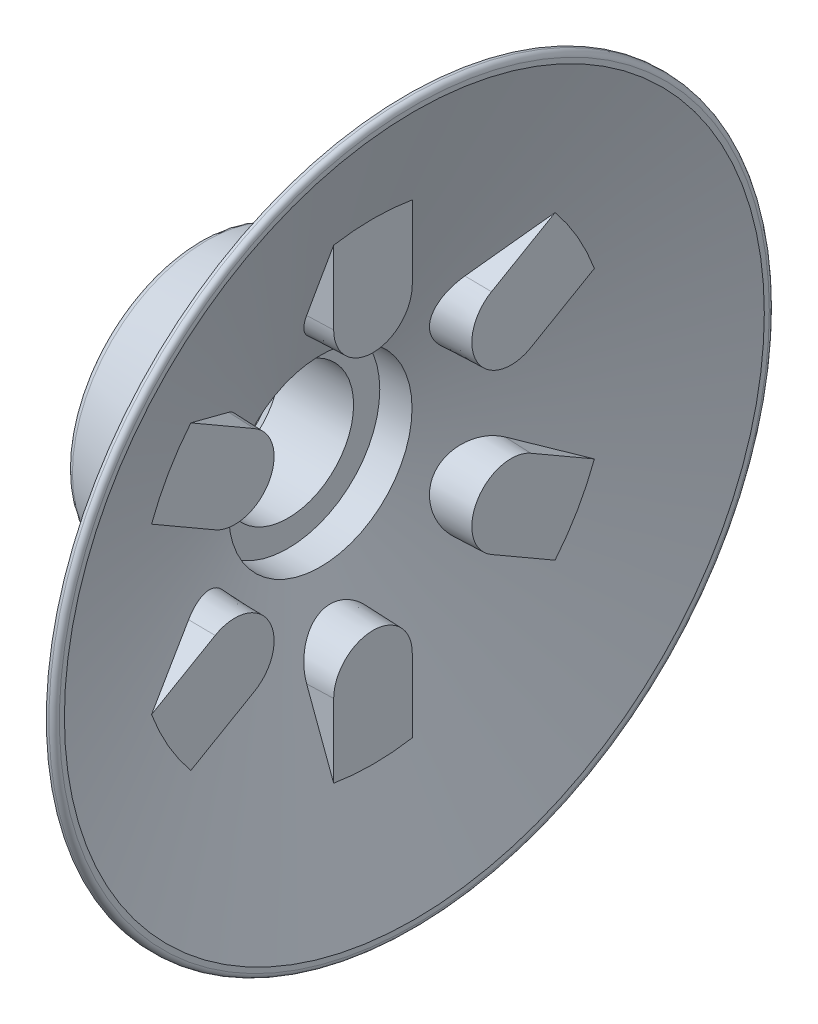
ISO-10303-21;
HEADER;
FILE_DESCRIPTION(('STEP AP214'),'2;1');
FILE_NAME('part.step','',(''),(''),'','','');
FILE_SCHEMA(('AUTOMOTIVE_DESIGN { 1 0 10303 214 1 1 1 1 }'));
ENDSEC;
DATA;
#1=APPLICATION_CONTEXT('core data for automotive mechanical design processes');
#2=APPLICATION_PROTOCOL_DEFINITION('international standard','automotive_design',2000,#1);
#3=PRODUCT_CONTEXT('',#1,'mechanical');
#4=PRODUCT('Part','Part','',(#3));
#5=PRODUCT_RELATED_PRODUCT_CATEGORY('part','',(#4));
#6=PRODUCT_DEFINITION_FORMATION('','',#4);
#7=PRODUCT_DEFINITION_CONTEXT('part definition',#1,'design');
#8=PRODUCT_DEFINITION('design','',#6,#7);
#9=PRODUCT_DEFINITION_SHAPE('','',#8);
#10=(LENGTH_UNIT() NAMED_UNIT(*) SI_UNIT(.MILLI.,.METRE.));
#11=(NAMED_UNIT(*) PLANE_ANGLE_UNIT() SI_UNIT($,.RADIAN.));
#12=(NAMED_UNIT(*) SI_UNIT($,.STERADIAN.) SOLID_ANGLE_UNIT());
#13=UNCERTAINTY_MEASURE_WITH_UNIT(LENGTH_MEASURE(1.E-05),#10,'distance_accuracy_value','');
#14=(GEOMETRIC_REPRESENTATION_CONTEXT(3) GLOBAL_UNCERTAINTY_ASSIGNED_CONTEXT((#13)) GLOBAL_UNIT_ASSIGNED_CONTEXT((#10,
#11,#12)) REPRESENTATION_CONTEXT('',''));
#15=CARTESIAN_POINT('',(0.,0.,0.));
#16=DIRECTION('',(0.,0.,1.));
#17=DIRECTION('',(1.,0.,0.));
#18=AXIS2_PLACEMENT_3D('',#15,#16,#17);
#19=CARTESIAN_POINT('',(0.,0.,0.));
#20=DIRECTION('',(1.,0.,0.));
#21=DIRECTION('',(0.,0.,-1.));
#22=AXIS2_PLACEMENT_3D('',#19,#20,#21);
#23=PLANE('',#22);
#24=CARTESIAN_POINT('',(0.,0.,0.));
#25=DIRECTION('',(1.,0.,0.));
#26=DIRECTION('',(0.,0.,-1.));
#27=AXIS2_PLACEMENT_3D('',#24,#25,#26);
#28=CIRCLE('',#27,33.9344);
#29=CARTESIAN_POINT('',(0.,0.,-33.9344));
#30=VERTEX_POINT('',#29);
#31=EDGE_CURVE('E495',#30,#30,#28,.T.);
#32=ORIENTED_EDGE('',*,*,#31,.F.);
#33=EDGE_LOOP('',(#32));
#34=FACE_BOUND('',#33,.T.);
#35=CARTESIAN_POINT('',(0.,0.,0.));
#36=DIRECTION('',(1.,0.,0.));
#37=DIRECTION('',(0.,0.,-1.));
#38=AXIS2_PLACEMENT_3D('',#35,#36,#37);
#39=CIRCLE('',#38,34.417);
#40=CARTESIAN_POINT('',(0.,0.,-34.417));
#41=VERTEX_POINT('',#40);
#42=EDGE_CURVE('E25',#41,#41,#39,.T.);
#43=ORIENTED_EDGE('',*,*,#42,.T.);
#44=EDGE_LOOP('',(#43));
#45=FACE_BOUND('',#44,.T.);
#46=ADVANCED_FACE('F16',(#34,#45),#23,.T.);
#47=CARTESIAN_POINT('',(0.,0.,0.));
#48=DIRECTION('',(1.,0.,0.));
#49=DIRECTION('',(0.,0.,-1.));
#50=AXIS2_PLACEMENT_3D('',#47,#48,#49);
#51=CYLINDRICAL_SURFACE('',#50,34.925);
#52=CARTESIAN_POINT('',(-0.508,0.,0.));
#53=DIRECTION('',(1.,0.,0.));
#54=DIRECTION('',(0.,0.,-1.));
#55=AXIS2_PLACEMENT_3D('',#52,#53,#54);
#56=CIRCLE('',#55,34.925);
#57=CARTESIAN_POINT('',(-0.508,0.,-34.925));
#58=VERTEX_POINT('',#57);
#59=EDGE_CURVE('E10',#58,#58,#56,.F.);
#60=ORIENTED_EDGE('',*,*,#59,.T.);
#61=EDGE_LOOP('',(#60));
#62=FACE_BOUND('',#61,.T.);
#63=CARTESIAN_POINT('',(-0.762,0.,0.));
#64=DIRECTION('',(1.,0.,0.));
#65=DIRECTION('',(0.,0.,-1.));
#66=AXIS2_PLACEMENT_3D('',#63,#64,#65);
#67=CIRCLE('',#66,34.925);
#68=CARTESIAN_POINT('',(-0.762,0.,-34.925));
#69=VERTEX_POINT('',#68);
#70=EDGE_CURVE('E499',#69,#69,#67,.T.);
#71=ORIENTED_EDGE('',*,*,#70,.T.);
#72=EDGE_LOOP('',(#71));
#73=FACE_BOUND('',#72,.T.);
#74=ADVANCED_FACE('F440',(#62,#73),#51,.T.);
#75=CARTESIAN_POINT('',(-0.762,0.,0.));
#76=DIRECTION('',(1.,0.,0.));
#77=DIRECTION('',(0.,0.,-1.));
#78=AXIS2_PLACEMENT_3D('',#75,#76,#77);
#79=CONICAL_SURFACE('',#78,34.925,1.04719755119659);
#80=CARTESIAN_POINT('',(-11.2211735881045,0.,0.));
#81=DIRECTION('',(1.,0.,0.));
#82=DIRECTION('',(0.,0.,-1.));
#83=AXIS2_PLACEMENT_3D('',#80,#81,#82);
#84=CIRCLE('',#83,16.8091799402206);
#85=CARTESIAN_POINT('',(-11.2211735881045,0.,-16.8091799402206));
#86=VERTEX_POINT('',#85);
#87=EDGE_CURVE('E465',#86,#86,#84,.T.);
#88=ORIENTED_EDGE('',*,*,#87,.T.);
#89=EDGE_LOOP('',(#88));
#90=FACE_BOUND('',#89,.T.);
#91=ORIENTED_EDGE('',*,*,#70,.F.);
#92=EDGE_LOOP('',(#91));
#93=FACE_BOUND('',#92,.T.);
#94=ADVANCED_FACE('F436',(#90,#93),#79,.T.);
#95=CARTESIAN_POINT('',(-12.1666,0.,0.));
#96=DIRECTION('',(1.,0.,0.));
#97=DIRECTION('',(0.,0.,-1.));
#98=AXIS2_PLACEMENT_3D('',#95,#96,#97);
#99=CONICAL_SURFACE('',#98,15.1716533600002,0.262894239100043);
#100=CARTESIAN_POINT('',(-13.9924866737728,0.,0.));
#101=DIRECTION('',(1.,0.,0.));
#102=DIRECTION('',(0.,0.,-1.));
#103=AXIS2_PLACEMENT_3D('',#100,#101,#102);
#104=CIRCLE('',#103,14.6802652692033);
#105=CARTESIAN_POINT('',(-13.9924866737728,0.,-14.6802652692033));
#106=VERTEX_POINT('',#105);
#107=EDGE_CURVE('E462',#106,#106,#104,.F.);
#108=ORIENTED_EDGE('',*,*,#107,.T.);
#109=EDGE_LOOP('',(#108));
#110=FACE_BOUND('',#109,.T.);
#111=CARTESIAN_POINT('',(-20.1268344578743,0.,0.));
#112=DIRECTION('',(-1.,0.,0.));
#113=DIRECTION('',(0.,0.,1.));
#114=AXIS2_PLACEMENT_3D('',#111,#112,#113);
#115=CIRCLE('',#114,13.0293712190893);
#116=CARTESIAN_POINT('',(-20.1268344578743,0.,13.0293712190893));
#117=VERTEX_POINT('',#116);
#118=EDGE_CURVE('E476',#117,#117,#115,.F.);
#119=ORIENTED_EDGE('',*,*,#118,.T.);
#120=EDGE_LOOP('',(#119));
#121=FACE_BOUND('',#120,.T.);
#122=ADVANCED_FACE('F432',(#110,#121),#99,.T.);
#123=CARTESIAN_POINT('',(-20.8788,12.827,0.));
#124=DIRECTION('',(-1.,0.,0.));
#125=DIRECTION('',(0.,0.,1.));
#126=AXIS2_PLACEMENT_3D('',#123,#124,#125);
#127=PLANE('',#126);
#128=CARTESIAN_POINT('',(-20.8788,0.,0.));
#129=DIRECTION('',(1.,0.,0.));
#130=DIRECTION('',(0.,0.,-1.));
#131=AXIS2_PLACEMENT_3D('',#128,#129,#130);
#132=CIRCLE('',#131,7.874);
#133=CARTESIAN_POINT('',(-20.8788,0.,-7.874));
#134=VERTEX_POINT('',#133);
#135=EDGE_CURVE('E593',#134,#134,#132,.T.);
#136=ORIENTED_EDGE('',*,*,#135,.T.);
#137=EDGE_LOOP('',(#136));
#138=FACE_BOUND('',#137,.T.);
#139=CARTESIAN_POINT('',(-20.8788,0.,0.));
#140=DIRECTION('',(-1.,0.,0.));
#141=DIRECTION('',(0.,0.,1.));
#142=AXIS2_PLACEMENT_3D('',#139,#140,#141);
#143=CIRCLE('',#142,12.0482790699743);
#144=CARTESIAN_POINT('',(-20.8788,0.,12.0482790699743));
#145=VERTEX_POINT('',#144);
#146=EDGE_CURVE('E467',#145,#145,#143,.T.);
#147=ORIENTED_EDGE('',*,*,#146,.T.);
#148=EDGE_LOOP('',(#147));
#149=FACE_BOUND('',#148,.T.);
#150=ADVANCED_FACE('F428',(#138,#149),#127,.T.);
#151=CARTESIAN_POINT('',(-19.8628,0.,0.));
#152=DIRECTION('',(-1.,0.,0.));
#153=DIRECTION('',(0.,0.,1.));
#154=AXIS2_PLACEMENT_3D('',#151,#152,#153);
#155=TOROIDAL_SURFACE('',#154,12.0482790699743,1.016);
#156=ORIENTED_EDGE('',*,*,#146,.F.);
#157=EDGE_LOOP('',(#156));
#158=FACE_BOUND('',#157,.T.);
#159=ORIENTED_EDGE('',*,*,#118,.F.);
#160=EDGE_LOOP('',(#159));
#161=FACE_BOUND('',#160,.T.);
#162=ADVANCED_FACE('F431',(#158,#161),#155,.T.);
#163=CARTESIAN_POINT('',(-15.180641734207,0.,0.));
#164=DIRECTION('',(1.,0.,0.));
#165=DIRECTION('',(0.,0.,-1.));
#166=AXIS2_PLACEMENT_3D('',#163,#164,#165);
#167=TOROIDAL_SURFACE('',#166,19.0951799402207,4.572);
#168=ORIENTED_EDGE('',*,*,#107,.F.);
#169=EDGE_LOOP('',(#168));
#170=FACE_BOUND('',#169,.T.);
#171=ORIENTED_EDGE('',*,*,#87,.F.);
#172=EDGE_LOOP('',(#171));
#173=FACE_BOUND('',#172,.T.);
#174=ADVANCED_FACE('F449',(#170,#173),#167,.F.);
#175=CARTESIAN_POINT('',(-0.508,0.,0.));
#176=DIRECTION('',(1.,0.,0.));
#177=DIRECTION('',(0.,0.,-1.));
#178=AXIS2_PLACEMENT_3D('',#175,#176,#177);
#179=TOROIDAL_SURFACE('',#178,34.417,0.508);
#180=ORIENTED_EDGE('',*,*,#59,.F.);
#181=EDGE_LOOP('',(#180));
#182=FACE_BOUND('',#181,.T.);
#183=ORIENTED_EDGE('',*,*,#42,.F.);
#184=EDGE_LOOP('',(#183));
#185=FACE_BOUND('',#184,.T.);
#186=ADVANCED_FACE('F18',(#182,#185),#179,.T.);
#187=CARTESIAN_POINT('',(0.,0.,0.));
#188=DIRECTION('',(1.,0.,0.));
#189=DIRECTION('',(0.,0.,-1.));
#190=AXIS2_PLACEMENT_3D('',#187,#188,#189);
#191=CONICAL_SURFACE('',#190,33.9344,1.22173047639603);
#192=CARTESIAN_POINT('',(-9.1154161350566,0.,0.));
#193=DIRECTION('',(1.,0.,0.));
#194=DIRECTION('',(0.,0.,-1.));
#195=AXIS2_PLACEMENT_3D('',#192,#193,#194);
#196=CIRCLE('',#195,8.89);
#197=CARTESIAN_POINT('',(-9.1154161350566,0.,-8.89));
#198=VERTEX_POINT('',#197);
#199=EDGE_CURVE('E590',#198,#198,#196,.T.);
#200=ORIENTED_EDGE('',*,*,#199,.F.);
#201=EDGE_LOOP('',(#200));
#202=FACE_BOUND('',#201,.T.);
#203=CARTESIAN_POINT('',(-4.013,7.99531356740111,21.4682753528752));
#204=CARTESIAN_POINT('',(-4.22688951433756,7.69022546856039,20.9547856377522));
#205=CARTESIAN_POINT('',(-4.44055377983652,7.38510372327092,20.441221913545));
#206=CARTESIAN_POINT('',(-4.86726730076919,6.77476953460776,19.4138944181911));
#207=CARTESIAN_POINT('',(-5.08031655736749,6.46955709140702,18.9001306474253));
#208=CARTESIAN_POINT('',(-5.50563655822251,5.85901666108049,17.872348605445));
#209=CARTESIAN_POINT('',(-5.71790730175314,5.55368867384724,17.3583303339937));
#210=CARTESIAN_POINT('',(-6.14138510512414,4.94287572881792,16.3299476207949));
#211=CARTESIAN_POINT('',(-6.3525921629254,4.63739077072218,15.8155831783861));
#212=CARTESIAN_POINT('',(-6.56312448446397,4.33180705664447,15.3010005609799));
#213=B_SPLINE_CURVE_WITH_KNOTS('',3,(#203,#204,#205,#206,#207,#208,#209,#210,#211,#212),
.UNSPECIFIED.,.F.,.F.,(4,2,2,2,4),(0.,1.9032847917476,3.80656597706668,5.70984893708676,
7.6131355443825),.UNSPECIFIED.);
#214=CARTESIAN_POINT('',(-4.0132,7.99502830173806,21.4677952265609));
#215=VERTEX_POINT('',#214);
#216=CARTESIAN_POINT('',(-6.54495692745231,4.35817712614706,15.3454060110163));
#217=VERTEX_POINT('',#216);
#218=EDGE_CURVE('E207',#215,#217,#213,.T.);
#219=ORIENTED_EDGE('',*,*,#218,.F.);
#220=CARTESIAN_POINT('',(-4.0132,0.,0.));
#221=DIRECTION('',(1.,0.,0.));
#222=DIRECTION('',(0.,0.,-1.));
#223=AXIS2_PLACEMENT_3D('',#220,#221,#222);
#224=CIRCLE('',#223,22.9082236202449);
#225=CARTESIAN_POINT('',(-4.0132,14.5941418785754,17.6577952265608));
#226=VERTEX_POINT('',#225);
#227=EDGE_CURVE('E197',#226,#215,#224,.T.);
#228=ORIENTED_EDGE('',*,*,#227,.F.);
#229=CARTESIAN_POINT('',(-6.60013155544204,11.0336567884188,11.3101788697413));
#230=CARTESIAN_POINT('',(-6.38659936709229,11.330815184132,11.839785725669));
#231=CARTESIAN_POINT('',(-6.17236056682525,11.6278274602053,12.3691888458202));
#232=CARTESIAN_POINT('',(-5.74277298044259,12.2216211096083,13.4276726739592));
#233=CARTESIAN_POINT('',(-5.52742419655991,12.5184024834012,13.956753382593));
#234=CARTESIAN_POINT('',(-5.09591923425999,13.1117965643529,15.0146790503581));
#235=CARTESIAN_POINT('',(-4.87976305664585,13.4084092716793,15.5435240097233));
#236=CARTESIAN_POINT('',(-4.4468150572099,14.0015025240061,16.60102941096));
#237=CARTESIAN_POINT('',(-4.2300232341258,14.2979830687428,17.1296898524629));
#238=CARTESIAN_POINT('',(-4.013,14.5944150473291,17.658282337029));
#239=B_SPLINE_CURVE_WITH_KNOTS('',3,(#229,#230,#231,#232,#233,#234,#235,#236,#237,#238),
.UNSPECIFIED.,.F.,.F.,(4,2,2,2,4),(0.,1.93117512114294,3.86234635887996,5.79351567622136,
7.72468883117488),.UNSPECIFIED.);
#240=CARTESIAN_POINT('',(-6.54495692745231,11.1104228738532,11.4469951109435));
#241=VERTEX_POINT('',#240);
#242=EDGE_CURVE('E182',#241,#226,#239,.T.);
#243=ORIENTED_EDGE('',*,*,#242,.F.);
#244=CARTESIAN_POINT('',(-6.44106060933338,4.52016490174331,15.5958978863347));
#245=CARTESIAN_POINT('',(-6.48142074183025,4.45279200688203,15.4999646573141));
#246=CARTESIAN_POINT('',(-6.52229614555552,4.38985613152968,15.4011479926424));
#247=CARTESIAN_POINT('',(-6.60481894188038,4.27320985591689,15.1985351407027));
#248=CARTESIAN_POINT('',(-6.64646623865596,4.21949831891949,15.0947395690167));
#249=CARTESIAN_POINT('',(-6.73027023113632,4.12165185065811,14.8829678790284));
#250=CARTESIAN_POINT('',(-6.7724267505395,4.0775136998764,14.7749931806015));
#251=CARTESIAN_POINT('',(-6.8569754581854,3.99907134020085,14.5556502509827));
#252=CARTESIAN_POINT('',(-6.89936765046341,3.96476730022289,14.4442819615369));
#253=CARTESIAN_POINT('',(-7.02647408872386,3.87697761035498,14.1062496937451));
#254=CARTESIAN_POINT('',(-7.11118547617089,3.83853603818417,13.8754880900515));
#255=CARTESIAN_POINT('',(-7.27785760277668,3.80337933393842,13.4097888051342));
#256=CARTESIAN_POINT('',(-7.35981842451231,3.8066629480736,13.1748512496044));
#257=CARTESIAN_POINT('',(-7.47821118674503,3.8432850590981,12.8247620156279));
#258=CARTESIAN_POINT('',(-7.51689132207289,3.8607514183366,12.7085340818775));
#259=CARTESIAN_POINT('',(-7.59234986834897,3.90624053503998,12.4775529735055));
#260=CARTESIAN_POINT('',(-7.6291290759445,3.93425882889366,12.3627991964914));
#261=CARTESIAN_POINT('',(-7.70033468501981,4.0008438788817,12.1355892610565));
#262=CARTESIAN_POINT('',(-7.73476007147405,4.03941515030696,12.0231341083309));
#263=CARTESIAN_POINT('',(-7.80071938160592,4.1269897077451,11.8015434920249));
#264=CARTESIAN_POINT('',(-7.83225480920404,4.17598752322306,11.6924063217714));
#265=CARTESIAN_POINT('',(-7.89031655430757,4.28134125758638,11.4841142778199));
#266=CARTESIAN_POINT('',(-7.91702085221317,4.33716129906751,11.3847379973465));
#267=CARTESIAN_POINT('',(-7.96690451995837,4.45772385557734,11.1906811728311));
#268=CARTESIAN_POINT('',(-7.99008567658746,4.52246181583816,11.0959982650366));
#269=CARTESIAN_POINT('',(-8.03247585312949,4.66049397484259,10.912205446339));
#270=CARTESIAN_POINT('',(-8.0516868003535,4.73378399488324,10.8230928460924));
#271=CARTESIAN_POINT('',(-8.08573170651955,4.88845833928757,10.6512868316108));
#272=CARTESIAN_POINT('',(-8.10056611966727,4.96984182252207,10.5685927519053));
#273=CARTESIAN_POINT('',(-8.12432140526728,5.13197381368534,10.4180106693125));
#274=CARTESIAN_POINT('',(-8.13367031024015,5.21204755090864,10.3494624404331));
#275=CARTESIAN_POINT('',(-8.14830617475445,5.37776440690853,10.2189130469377));
#276=CARTESIAN_POINT('',(-8.15359178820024,5.46340936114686,10.1569140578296));
#277=CARTESIAN_POINT('',(-8.15997783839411,5.6395104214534,10.0400829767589));
#278=CARTESIAN_POINT('',(-8.16108143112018,5.72996284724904,9.98524551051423));
#279=CARTESIAN_POINT('',(-8.15908782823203,5.9150338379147,9.88312338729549));
#280=CARTESIAN_POINT('',(-8.15598911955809,6.00965389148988,9.83584145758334));
#281=CARTESIAN_POINT('',(-8.14599339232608,6.19594241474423,9.75204905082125));
#282=CARTESIAN_POINT('',(-8.13935799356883,6.28739931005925,9.71503640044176));
#283=CARTESIAN_POINT('',(-8.12260252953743,6.47258356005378,9.64813823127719));
#284=CARTESIAN_POINT('',(-8.11248126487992,6.56631168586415,9.61825517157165));
#285=CARTESIAN_POINT('',(-8.07714495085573,6.84984783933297,9.53954867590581));
#286=CARTESIAN_POINT('',(-8.04694767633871,7.04218018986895,9.50159078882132));
#287=CARTESIAN_POINT('',(-7.97436816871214,7.43270832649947,9.45437344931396));
#288=CARTESIAN_POINT('',(-7.93171300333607,7.63093470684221,9.44581862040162));
#289=CARTESIAN_POINT('',(-7.83690020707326,8.02413999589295,9.45842226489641));
#290=CARTESIAN_POINT('',(-7.78473962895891,8.21911787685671,9.47958996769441));
#291=CARTESIAN_POINT('',(-7.66852680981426,8.61796896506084,9.5531912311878));
#292=CARTESIAN_POINT('',(-7.60384141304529,8.82119573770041,9.60812238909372));
#293=CARTESIAN_POINT('',(-7.4687368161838,9.21459203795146,9.74892972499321));
#294=CARTESIAN_POINT('',(-7.39831560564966,9.40475694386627,9.83481678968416));
#295=CARTESIAN_POINT('',(-7.24807452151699,9.78319439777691,10.0432753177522));
#296=CARTESIAN_POINT('',(-7.16795949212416,9.97000273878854,10.1682979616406));
#297=CARTESIAN_POINT('',(-7.00622807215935,10.3192386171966,10.4480434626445));
#298=CARTESIAN_POINT('',(-6.9246109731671,10.4816543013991,10.6027806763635));
#299=CARTESIAN_POINT('',(-6.75860044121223,10.7842038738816,10.9450209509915));
#300=CARTESIAN_POINT('',(-6.67423675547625,10.9230946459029,11.1336385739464));
#301=CARTESIAN_POINT('',(-6.50847375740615,11.1653779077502,11.5334431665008));
#302=CARTESIAN_POINT('',(-6.42707107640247,11.2688119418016,11.7446033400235));
#303=CARTESIAN_POINT('',(-6.30869098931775,11.3946142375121,12.0735951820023));
#304=CARTESIAN_POINT('',(-6.26984089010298,11.4316633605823,12.1853352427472));
#305=CARTESIAN_POINT('',(-6.1936325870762,11.4955835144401,12.4119867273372));
#306=CARTESIAN_POINT('',(-6.15627227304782,11.522469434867,12.5268932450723));
#307=CARTESIAN_POINT('',(-6.11972005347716,11.5441411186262,12.6431009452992));
#308=B_SPLINE_CURVE_WITH_KNOTS('',3,(#244,#245,#246,#247,#248,#249,#250,#251,#252,#253,#254,
#255,#256,#257,#258,#259,#260,#261,#262,#263,#264,#265,#266,#267,#268,#269,#270,#271,#272,#273,
#274,#275,#276,#277,#278,#279,#280,#281,#282,#283,#284,#285,#286,#287,#288,#289,#290,#291,#292,
#293,#294,#295,#296,#297,#298,#299,#300,#301,#302,#303,#304,#305,#306,#307),.UNSPECIFIED.,.F.,
.F.,(4,2,2,2,2,2,2,2,2,2,2,2,2,2,2,2,2,2,2,2,2,2,2,2,2,2,2,2,2,2,2,4),(0.,0.371809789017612,
0.743573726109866,1.11521244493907,1.48685754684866,2.22955795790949,2.97223605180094,
3.34304510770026,3.7136974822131,4.08450869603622,4.45512583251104,4.80585690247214,
5.15640949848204,5.5067915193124,5.85713716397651,6.17418562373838,6.4913390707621,
6.8082531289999,7.12528132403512,7.4215791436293,7.71797901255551,8.31021796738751,
8.91655414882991,9.52307865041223,10.1810029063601,10.8391587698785,11.5518844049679,
12.2649552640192,13.0083864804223,13.7509436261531,14.1224377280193,14.4933854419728),.UNSPECIFIED.);
#309=EDGE_CURVE('E191',#217,#241,#308,.T.);
#310=ORIENTED_EDGE('',*,*,#309,.F.);
#311=EDGE_LOOP('',(#219,#228,#243,#310));
#312=FACE_BOUND('',#311,.T.);
#313=CARTESIAN_POINT('',(-4.013,-14.5944150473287,17.6582823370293));
#314=CARTESIAN_POINT('',(-4.2300232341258,-14.2979830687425,17.1296898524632));
#315=CARTESIAN_POINT('',(-4.4468150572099,-14.0015025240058,16.6010294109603));
#316=CARTESIAN_POINT('',(-4.87976305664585,-13.4084092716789,15.5435240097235));
#317=CARTESIAN_POINT('',(-5.09591923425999,-13.1117965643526,15.0146790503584));
#318=CARTESIAN_POINT('',(-5.52742419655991,-12.5184024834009,13.9567533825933));
#319=CARTESIAN_POINT('',(-5.7427729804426,-12.2216211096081,13.4276726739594));
#320=CARTESIAN_POINT('',(-6.17236056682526,-11.627827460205,12.3691888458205));
#321=CARTESIAN_POINT('',(-6.3865993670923,-11.3308151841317,11.8397857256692));
#322=CARTESIAN_POINT('',(-6.60013155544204,-11.0336567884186,11.3101788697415));
#323=B_SPLINE_CURVE_WITH_KNOTS('',3,(#313,#314,#315,#316,#317,#318,#319,#320,#321,#322),
.UNSPECIFIED.,.F.,.F.,(4,2,2,2,4),(0.,1.93117315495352,3.86234247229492,5.79351371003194,
7.72468883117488),.UNSPECIFIED.);
#324=CARTESIAN_POINT('',(-4.0132,-14.5941418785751,17.6577952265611));
#325=VERTEX_POINT('',#324);
#326=CARTESIAN_POINT('',(-6.54495692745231,-11.110422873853,11.4469951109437));
#327=VERTEX_POINT('',#326);
#328=EDGE_CURVE('E209',#325,#327,#323,.T.);
#329=ORIENTED_EDGE('',*,*,#328,.F.);
#330=CARTESIAN_POINT('',(-4.0132,0.,0.));
#331=DIRECTION('',(1.,0.,0.));
#332=DIRECTION('',(0.,0.,-1.));
#333=AXIS2_PLACEMENT_3D('',#330,#331,#332);
#334=CIRCLE('',#333,22.9082236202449);
#335=CARTESIAN_POINT('',(-4.0132,-7.99502830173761,21.4677952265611));
#336=VERTEX_POINT('',#335);
#337=EDGE_CURVE('E673',#336,#325,#334,.T.);
#338=ORIENTED_EDGE('',*,*,#337,.F.);
#339=CARTESIAN_POINT('',(-6.56312448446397,-4.33180705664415,15.30100056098));
#340=CARTESIAN_POINT('',(-6.3525921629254,-4.63739077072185,15.8155831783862));
#341=CARTESIAN_POINT('',(-6.14138510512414,-4.94287572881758,16.329947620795));
#342=CARTESIAN_POINT('',(-5.71790730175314,-5.55368867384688,17.3583303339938));
#343=CARTESIAN_POINT('',(-5.50563655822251,-5.85901666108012,17.8723486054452));
#344=CARTESIAN_POINT('',(-5.08031655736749,-6.46955709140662,18.9001306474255));
#345=CARTESIAN_POINT('',(-4.86726730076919,-6.77476953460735,19.4138944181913));
#346=CARTESIAN_POINT('',(-4.44055377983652,-7.3851037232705,20.4412219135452));
#347=CARTESIAN_POINT('',(-4.22688951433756,-7.69022546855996,20.9547856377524));
#348=CARTESIAN_POINT('',(-4.013,-7.99531356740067,21.4682753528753));
#349=B_SPLINE_CURVE_WITH_KNOTS('',3,(#339,#340,#341,#342,#343,#344,#345,#346,#347,#348),
.UNSPECIFIED.,.F.,.F.,(4,2,2,2,4),(0.,1.90328660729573,3.80656956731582,5.70985075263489,
7.6131355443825),.UNSPECIFIED.);
#350=CARTESIAN_POINT('',(-6.54495692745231,-4.35817712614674,15.3454060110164));
#351=VERTEX_POINT('',#350);
#352=EDGE_CURVE('E245',#351,#336,#349,.T.);
#353=ORIENTED_EDGE('',*,*,#352,.F.);
#354=CARTESIAN_POINT('',(-6.11972005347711,-11.5441411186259,12.6431009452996));
#355=CARTESIAN_POINT('',(-6.15576625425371,-11.5227790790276,12.5284918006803));
#356=CARTESIAN_POINT('',(-6.19261776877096,-11.4963170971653,12.4151040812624));
#357=CARTESIAN_POINT('',(-6.267708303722,-11.4335649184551,12.1915826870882));
#358=CARTESIAN_POINT('',(-6.3059470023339,-11.3972769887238,12.0814482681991));
#359=CARTESIAN_POINT('',(-6.38354890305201,-11.3152942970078,11.8653489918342));
#360=CARTESIAN_POINT('',(-6.42291038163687,-11.2696133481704,11.7593782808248));
#361=CARTESIAN_POINT('',(-6.50257194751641,-11.169259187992,11.5521861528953));
#362=CARTESIAN_POINT('',(-6.54287207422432,-11.1145855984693,11.4509649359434));
#363=CARTESIAN_POINT('',(-6.66480021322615,-10.9377818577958,11.1555532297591));
#364=CARTESIAN_POINT('',(-6.74755823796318,-10.8027597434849,10.9693295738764));
#365=CARTESIAN_POINT('',(-6.91388354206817,-10.5025529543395,10.6235682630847));
#366=CARTESIAN_POINT('',(-6.99745100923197,-10.3373611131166,10.4640369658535));
#367=CARTESIAN_POINT('',(-7.16481446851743,-9.97757501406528,10.1729745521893));
#368=CARTESIAN_POINT('',(-7.24858016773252,-9.78244843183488,10.0420829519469));
#369=CARTESIAN_POINT('',(-7.41177225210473,-9.37030749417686,9.81666093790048));
#370=CARTESIAN_POINT('',(-7.49119799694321,-9.15328992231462,9.72213587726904));
#371=CARTESIAN_POINT('',(-7.60382936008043,-8.81768707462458,9.61106867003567));
#372=CARTESIAN_POINT('',(-7.64005960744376,-8.70495478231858,9.57928294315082));
#373=CARTESIAN_POINT('',(-7.71014183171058,-8.47640679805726,9.52586056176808));
#374=CARTESIAN_POINT('',(-7.74399491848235,-8.36059258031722,9.50421914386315));
#375=CARTESIAN_POINT('',(-7.8088375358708,-8.12667978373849,9.47145013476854));
#376=CARTESIAN_POINT('',(-7.83982664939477,-8.00858087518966,9.46032407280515));
#377=CARTESIAN_POINT('',(-7.89840238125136,-7.77107642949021,9.44890857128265));
#378=CARTESIAN_POINT('',(-7.92599084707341,-7.6516716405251,9.44861322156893));
#379=CARTESIAN_POINT('',(-7.97549738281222,-7.42069241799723,9.45872897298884));
#380=CARTESIAN_POINT('',(-7.99767429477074,-7.30914130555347,9.46840878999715));
#381=CARTESIAN_POINT('',(-8.03820425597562,-7.08666074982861,9.49747843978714));
#382=CARTESIAN_POINT('',(-8.05655927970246,-6.97573101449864,9.51686324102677));
#383=CARTESIAN_POINT('',(-8.08906848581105,-6.75543623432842,9.56534275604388));
#384=CARTESIAN_POINT('',(-8.10322457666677,-6.6460705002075,9.5944330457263));
#385=CARTESIAN_POINT('',(-8.12702386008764,-6.4298522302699,9.6622135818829));
#386=CARTESIAN_POINT('',(-8.13666747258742,-6.32299946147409,9.7009029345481));
#387=CARTESIAN_POINT('',(-8.15051358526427,-6.12288398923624,9.78347212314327));
#388=CARTESIAN_POINT('',(-8.15514837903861,-6.02929913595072,9.82650124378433));
#389=CARTESIAN_POINT('',(-8.16044469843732,-5.84572027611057,9.91992122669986));
#390=CARTESIAN_POINT('',(-8.16110492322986,-5.75572745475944,9.97031449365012));
#391=CARTESIAN_POINT('',(-8.15843300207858,-5.58012393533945,10.0780370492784));
#392=CARTESIAN_POINT('',(-8.1551032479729,-5.49451064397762,10.1353621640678));
#393=CARTESIAN_POINT('',(-8.14453029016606,-5.32824345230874,10.2564970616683));
#394=CARTESIAN_POINT('',(-8.13728563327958,-5.24759140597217,10.3203092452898));
#395=CARTESIAN_POINT('',(-8.11066513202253,-5.02074569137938,10.5148934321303));
#396=CARTESIAN_POINT('',(-8.08625113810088,-4.88184435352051,10.6536668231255));
#397=CARTESIAN_POINT('',(-8.02522532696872,-4.62760488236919,10.9487965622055));
#398=CARTESIAN_POINT('',(-7.98861144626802,-4.51227074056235,11.1051558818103));
#399=CARTESIAN_POINT('',(-7.90337535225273,-4.30224131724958,11.4388287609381));
#400=CARTESIAN_POINT('',(-7.85427507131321,-4.20875093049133,11.6167777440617));
#401=CARTESIAN_POINT('',(-7.74757495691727,-4.05075457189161,11.982672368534));
#402=CARTESIAN_POINT('',(-7.68997235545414,-3.98625806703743,12.170621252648));
#403=CARTESIAN_POINT('',(-7.56315834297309,-3.88219441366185,12.5694230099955));
#404=CARTESIAN_POINT('',(-7.49336869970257,-3.84539393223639,12.7808146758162));
#405=CARTESIAN_POINT('',(-7.34915825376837,-3.80666098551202,13.2052549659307));
#406=CARTESIAN_POINT('',(-7.27473496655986,-3.80474739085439,13.4183044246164));
#407=CARTESIAN_POINT('',(-7.11792416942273,-3.83639597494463,13.8568715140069));
#408=CARTESIAN_POINT('',(-7.03535659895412,-3.87261407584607,14.0821342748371));
#409=CARTESIAN_POINT('',(-6.87000687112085,-3.98349450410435,14.5227960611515));
#410=CARTESIAN_POINT('',(-6.78722492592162,-4.05812743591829,14.7382024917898));
#411=CARTESIAN_POINT('',(-6.66055864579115,-4.2018468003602,15.0594666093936));
#412=CARTESIAN_POINT('',(-6.61598148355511,-4.25823346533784,15.1708883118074));
#413=CARTESIAN_POINT('',(-6.52776825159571,-4.38145767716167,15.3879107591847));
#414=CARTESIAN_POINT('',(-6.48413074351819,-4.44827773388,15.493520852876));
#415=CARTESIAN_POINT('',(-6.44106060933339,-4.52016490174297,15.5958978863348));
#416=B_SPLINE_CURVE_WITH_KNOTS('',3,(#354,#355,#356,#357,#358,#359,#360,#361,#362,#363,#364,
#365,#366,#367,#368,#369,#370,#371,#372,#373,#374,#375,#376,#377,#378,#379,#380,#381,#382,#383,
#384,#385,#386,#387,#388,#389,#390,#391,#392,#393,#394,#395,#396,#397,#398,#399,#400,#401,#402,
#403,#404,#405,#406,#407,#408,#409,#410,#411,#412,#413,#414,#415),.UNSPECIFIED.,.F.,.F.,(4,2,2,
2,2,2,2,2,2,2,2,2,2,2,2,2,2,2,2,2,2,2,2,2,2,2,2,2,2,2,4),(0.,0.365945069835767,
0.731805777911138,1.0971322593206,1.46247410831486,2.19220400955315,2.92210747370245,
3.66694160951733,4.4118853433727,4.77930186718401,5.14654569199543,5.51384291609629,
5.88093970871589,6.22291521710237,6.56471361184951,6.90635641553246,7.24796741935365,
7.55689574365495,7.86592517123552,8.17476944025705,8.48372842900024,9.07439904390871,
9.66516961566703,10.283331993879,10.9016960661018,11.5757231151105,12.2501147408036,
12.9747929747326,13.6989174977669,14.0962178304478,14.4928591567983),.UNSPECIFIED.);
#417=EDGE_CURVE('E217',#327,#351,#416,.T.);
#418=ORIENTED_EDGE('',*,*,#417,.F.);
#419=EDGE_LOOP('',(#329,#338,#353,#418));
#420=FACE_BOUND('',#419,.T.);
#421=CARTESIAN_POINT('',(-4.013,-22.5897286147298,-3.80999301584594));
#422=CARTESIAN_POINT('',(-4.22535751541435,-21.9967677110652,-3.81740870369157));
#423=CARTESIAN_POINT('',(-4.43749277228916,-21.4037269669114,-3.82481663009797));
#424=CARTESIAN_POINT('',(-4.86115821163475,-20.2174303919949,-3.83961135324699));
#425=CARTESIAN_POINT('',(-5.07268839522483,-19.6241745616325,-3.84699815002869));
#426=CARTESIAN_POINT('',(-5.49498410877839,-18.4373896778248,-3.86174504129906));
#427=CARTESIAN_POINT('',(-5.70574963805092,-17.8438606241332,-3.86910513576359));
#428=CARTESIAN_POINT('',(-6.12623907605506,-16.6564320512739,-3.88378895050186));
#429=CARTESIAN_POINT('',(-6.33596298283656,-16.062532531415,-3.89111267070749));
#430=CARTESIAN_POINT('',(-6.54502729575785,-15.4684,-3.89841335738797));
#431=B_SPLINE_CURVE_WITH_KNOTS('',3,(#421,#422,#423,#424,#425,#426,#427,#428,#429,#430),
.UNSPECIFIED.,.F.,.F.,(4,2,2,2,4),(0.,1.8896509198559,3.77929834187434,5.66894747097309,
7.55860013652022),.UNSPECIFIED.);
#432=CARTESIAN_POINT('',(-4.0132,-22.5891701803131,-3.80999999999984));
#433=VERTEX_POINT('',#432);
#434=CARTESIAN_POINT('',(-6.54495692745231,-15.4686,-3.89841090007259));
#435=VERTEX_POINT('',#434);
#436=EDGE_CURVE('E268',#433,#435,#431,.T.);
#437=ORIENTED_EDGE('',*,*,#436,.F.);
#438=CARTESIAN_POINT('',(-4.0132,0.,0.));
#439=DIRECTION('',(1.,0.,0.));
#440=DIRECTION('',(0.,0.,-1.));
#441=AXIS2_PLACEMENT_3D('',#438,#439,#440);
#442=CIRCLE('',#441,22.9082236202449);
#443=CARTESIAN_POINT('',(-4.0132,-22.589170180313,3.81000000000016));
#444=VERTEX_POINT('',#443);
#445=EDGE_CURVE('E524',#444,#433,#442,.T.);
#446=ORIENTED_EDGE('',*,*,#445,.F.);
#447=CARTESIAN_POINT('',(-6.54502729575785,-15.4684,3.89841335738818));
#448=CARTESIAN_POINT('',(-6.33596298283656,-16.062532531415,3.89111267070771));
#449=CARTESIAN_POINT('',(-6.12623907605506,-16.6564320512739,3.88378895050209));
#450=CARTESIAN_POINT('',(-5.70574963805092,-17.8438606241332,3.86910513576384));
#451=CARTESIAN_POINT('',(-5.49498410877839,-18.4373896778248,3.86174504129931));
#452=CARTESIAN_POINT('',(-5.07268839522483,-19.6241745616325,3.84699815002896));
#453=CARTESIAN_POINT('',(-4.86115821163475,-20.2174303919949,3.83961135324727));
#454=CARTESIAN_POINT('',(-4.43749277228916,-21.4037269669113,3.82481663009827));
#455=CARTESIAN_POINT('',(-4.22535751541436,-21.9967677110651,3.81740870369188));
#456=CARTESIAN_POINT('',(-4.013,-22.5897286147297,3.80999301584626));
#457=B_SPLINE_CURVE_WITH_KNOTS('',3,(#447,#448,#449,#450,#451,#452,#453,#454,#455,#456),
.UNSPECIFIED.,.F.,.F.,(4,2,2,2,4),(0.,1.88965266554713,3.77930179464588,5.66894921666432,
7.55860013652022),.UNSPECIFIED.);
#458=CARTESIAN_POINT('',(-6.54495692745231,-15.4686,3.8984109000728));
#459=VERTEX_POINT('',#458);
#460=EDGE_CURVE('E284',#459,#444,#457,.T.);
#461=ORIENTED_EDGE('',*,*,#460,.F.);
#462=CARTESIAN_POINT('',(-6.54488655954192,-15.4688,-3.89840843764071));
#463=CARTESIAN_POINT('',(-6.58608191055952,-15.3517027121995,-3.8998607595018));
#464=CARTESIAN_POINT('',(-6.62768991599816,-15.2346962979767,-3.8960362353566));
#465=CARTESIAN_POINT('',(-6.71146149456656,-15.0017011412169,-3.87796543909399));
#466=CARTESIAN_POINT('',(-6.75362502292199,-14.8857123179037,-3.86372000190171));
#467=CARTESIAN_POINT('',(-6.83824932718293,-14.655556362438,-3.82493734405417));
#468=CARTESIAN_POINT('',(-6.88071013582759,-14.5413894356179,-3.80039897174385));
#469=CARTESIAN_POINT('',(-6.96561940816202,-14.3157277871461,-3.74123770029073));
#470=CARTESIAN_POINT('',(-7.00806787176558,-14.2042330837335,-3.7066147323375));
#471=CARTESIAN_POINT('',(-7.13496108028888,-13.8748844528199,-3.58791392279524));
#472=CARTESIAN_POINT('',(-7.2190038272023,-13.6620295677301,-3.48898104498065));
#473=CARTESIAN_POINT('',(-7.38305914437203,-13.2562770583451,-3.25380349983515));
#474=CARTESIAN_POINT('',(-7.46307231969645,-13.0633764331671,-3.11756445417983));
#475=CARTESIAN_POINT('',(-7.5770653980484,-12.7946792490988,-2.88855708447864));
#476=CARTESIAN_POINT('',(-7.61388444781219,-12.7089447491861,-2.80858662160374));
#477=CARTESIAN_POINT('',(-7.68524850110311,-12.5445799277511,-2.64074631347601));
#478=CARTESIAN_POINT('',(-7.71979450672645,-12.4659464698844,-2.55287999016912));
#479=CARTESIAN_POINT('',(-7.78613748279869,-12.3164893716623,-2.36972602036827));
#480=CARTESIAN_POINT('',(-7.81793356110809,-12.2456682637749,-2.27443598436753));
#481=CARTESIAN_POINT('',(-7.8782309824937,-12.1126301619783,-2.07711322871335));
#482=CARTESIAN_POINT('',(-7.90673411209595,-12.0504084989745,-1.97508421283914));
#483=CARTESIAN_POINT('',(-7.95819045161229,-11.9390167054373,-1.77183682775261));
#484=CARTESIAN_POINT('',(-7.98138461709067,-11.889259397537,-1.67100117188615));
#485=CARTESIAN_POINT('',(-8.02400523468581,-11.7984376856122,-1.46477660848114));
#486=CARTESIAN_POINT('',(-8.04343362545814,-11.7573688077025,-1.35939007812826));
#487=CARTESIAN_POINT('',(-8.07812725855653,-11.6844220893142,-1.14487422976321));
#488=CARTESIAN_POINT('',(-8.09339461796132,-11.6525395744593,-1.03574684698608));
#489=CARTESIAN_POINT('',(-8.11943315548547,-11.5983705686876,-0.814612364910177));
#490=CARTESIAN_POINT('',(-8.13020476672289,-11.5760831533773,-0.702605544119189));
#491=CARTESIAN_POINT('',(-8.14618578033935,-11.5430885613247,-0.487577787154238));
#492=CARTESIAN_POINT('',(-8.15183013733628,-11.5314745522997,-0.384727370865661));
#493=CARTESIAN_POINT('',(-8.1591197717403,-11.5164841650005,-0.178250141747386));
#494=CARTESIAN_POINT('',(-8.16076373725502,-11.5131104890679,-0.0746230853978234));
#495=CARTESIAN_POINT('',(-8.16001153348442,-11.5146552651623,0.132495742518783));
#496=CARTESIAN_POINT('',(-8.15761787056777,-11.5195685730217,0.235987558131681));
#497=CARTESIAN_POINT('',(-8.14885166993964,-11.5376059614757,0.442094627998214));
#498=CARTESIAN_POINT('',(-8.14247766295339,-11.550733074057,0.54470954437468));
#499=CARTESIAN_POINT('',(-8.11836003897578,-11.6005734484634,0.840149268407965));
#500=CARTESIAN_POINT('',(-8.09554689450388,-11.6478811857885,1.03089820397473));
#501=CARTESIAN_POINT('',(-8.03748961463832,-11.7697972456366,1.40130793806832));
#502=CARTESIAN_POINT('',(-8.00224353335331,-11.8444098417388,1.58096699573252));
#503=CARTESIAN_POINT('',(-7.91972144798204,-12.0219085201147,1.93258926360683));
#504=CARTESIAN_POINT('',(-7.87200451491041,-12.1258452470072,2.10391772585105));
#505=CARTESIAN_POINT('',(-7.76785289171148,-12.3570742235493,2.42699539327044));
#506=CARTESIAN_POINT('',(-7.7114156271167,-12.4843733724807,2.57873879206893));
#507=CARTESIAN_POINT('',(-7.58685365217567,-12.7711373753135,2.87264923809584));
#508=CARTESIAN_POINT('',(-7.51813543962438,-12.9324587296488,3.01275395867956));
#509=CARTESIAN_POINT('',(-7.37581262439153,-13.2743251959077,3.26418281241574));
#510=CARTESIAN_POINT('',(-7.30220487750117,-13.4548827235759,3.3754881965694));
#511=CARTESIAN_POINT('',(-7.1466673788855,-13.8451667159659,3.57462632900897));
#512=CARTESIAN_POINT('',(-7.06453289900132,-14.0560685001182,3.65999653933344));
#513=CARTESIAN_POINT('',(-6.8998033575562,-14.4891264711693,3.79291124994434));
#514=CARTESIAN_POINT('',(-6.81720893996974,-14.7112693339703,3.84049946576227));
#515=CARTESIAN_POINT('',(-6.70337280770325,-15.024220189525,3.87959377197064));
#516=CARTESIAN_POINT('',(-6.67138125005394,-15.1129300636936,3.88760824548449));
#517=CARTESIAN_POINT('',(-6.60781454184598,-15.2906654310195,3.89755791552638));
#518=CARTESIAN_POINT('',(-6.57623876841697,-15.3796901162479,3.89950357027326));
#519=CARTESIAN_POINT('',(-6.5448865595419,-15.4688,3.89840843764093));
#520=B_SPLINE_CURVE_WITH_KNOTS('',3,(#462,#463,#464,#465,#466,#467,#468,#469,#470,#471,#472,
#473,#474,#475,#476,#477,#478,#479,#480,#481,#482,#483,#484,#485,#486,#487,#488,#489,#490,#491,
#492,#493,#494,#495,#496,#497,#498,#499,#500,#501,#502,#503,#504,#505,#506,#507,#508,#509,#510,
#511,#512,#513,#514,#515,#516,#517,#518,#519),.UNSPECIFIED.,.F.,.F.,(4,2,2,2,2,2,2,2,2,2,2,2,2,
2,2,2,2,2,2,2,2,2,2,2,2,2,2,2,4),(0.,0.372293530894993,0.744557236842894,1.11686260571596,
1.48917051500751,2.23335031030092,2.97741802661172,3.34568243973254,3.71378339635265,
4.08200332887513,4.45002254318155,4.7939928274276,5.13778555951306,5.48140304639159,
5.82498742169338,6.13556274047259,6.44623989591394,6.75672426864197,7.06732331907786,
7.65794286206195,8.24865488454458,8.86403666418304,9.47960046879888,10.1500851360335,
10.8210052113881,11.5435070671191,12.2651717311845,12.5489421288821,12.8322232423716),.UNSPECIFIED.);
#521=EDGE_CURVE('E276',#435,#459,#520,.T.);
#522=ORIENTED_EDGE('',*,*,#521,.F.);
#523=EDGE_LOOP('',(#437,#446,#461,#522));
#524=FACE_BOUND('',#523,.T.);
#525=CARTESIAN_POINT('',(-4.013,-7.99531356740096,-21.4682753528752));
#526=CARTESIAN_POINT('',(-4.22688951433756,-7.69022546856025,-20.9547856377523));
#527=CARTESIAN_POINT('',(-4.44055377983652,-7.38510372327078,-20.4412219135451));
#528=CARTESIAN_POINT('',(-4.86726730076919,-6.77476953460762,-19.4138944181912));
#529=CARTESIAN_POINT('',(-5.08031655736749,-6.46955709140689,-18.9001306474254));
#530=CARTESIAN_POINT('',(-5.50563655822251,-5.85901666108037,-17.8723486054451));
#531=CARTESIAN_POINT('',(-5.71790730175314,-5.55368867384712,-17.3583303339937));
#532=CARTESIAN_POINT('',(-6.14138510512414,-4.94287572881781,-16.329947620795));
#533=CARTESIAN_POINT('',(-6.3525921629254,-4.63739077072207,-15.8155831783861));
#534=CARTESIAN_POINT('',(-6.56312448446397,-4.33180705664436,-15.3010005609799));
#535=B_SPLINE_CURVE_WITH_KNOTS('',3,(#525,#526,#527,#528,#529,#530,#531,#532,#533,#534),
.UNSPECIFIED.,.F.,.F.,(4,2,2,2,4),(0.,1.9032847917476,3.80656597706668,5.70984893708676,
7.6131355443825),.UNSPECIFIED.);
#536=CARTESIAN_POINT('',(-4.0132,-7.99502830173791,-21.467795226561));
#537=VERTEX_POINT('',#536);
#538=CARTESIAN_POINT('',(-6.54495692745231,-4.35817712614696,-15.3454060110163));
#539=VERTEX_POINT('',#538);
#540=EDGE_CURVE('E309',#537,#539,#535,.T.);
#541=ORIENTED_EDGE('',*,*,#540,.F.);
#542=CARTESIAN_POINT('',(-4.0132,0.,0.));
#543=DIRECTION('',(1.,0.,0.));
#544=DIRECTION('',(0.,0.,-1.));
#545=AXIS2_PLACEMENT_3D('',#542,#543,#544);
#546=CIRCLE('',#545,22.9082236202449);
#547=CARTESIAN_POINT('',(-4.0132,-14.5941418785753,-17.6577952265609));
#548=VERTEX_POINT('',#547);
#549=EDGE_CURVE('E953',#548,#537,#546,.T.);
#550=ORIENTED_EDGE('',*,*,#549,.F.);
#551=CARTESIAN_POINT('',(-6.60013155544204,-11.0336567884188,-11.3101788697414));
#552=CARTESIAN_POINT('',(-6.38659936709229,-11.3308151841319,-11.839785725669));
#553=CARTESIAN_POINT('',(-6.17236056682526,-11.6278274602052,-12.3691888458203));
#554=CARTESIAN_POINT('',(-5.74277298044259,-12.2216211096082,-13.4276726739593));
#555=CARTESIAN_POINT('',(-5.52742419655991,-12.5184024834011,-13.9567533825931));
#556=CARTESIAN_POINT('',(-5.09591923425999,-13.1117965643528,-15.0146790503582));
#557=CARTESIAN_POINT('',(-4.87976305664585,-13.4084092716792,-15.5435240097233));
#558=CARTESIAN_POINT('',(-4.4468150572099,-14.001502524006,-16.6010294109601));
#559=CARTESIAN_POINT('',(-4.2300232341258,-14.2979830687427,-17.129689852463));
#560=CARTESIAN_POINT('',(-4.013,-14.594415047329,-17.6582823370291));
#561=B_SPLINE_CURVE_WITH_KNOTS('',3,(#551,#552,#553,#554,#555,#556,#557,#558,#559,#560),
.UNSPECIFIED.,.F.,.F.,(4,2,2,2,4),(0.,1.93117512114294,3.86234635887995,5.79351567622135,
7.72468883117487),.UNSPECIFIED.);
#562=CARTESIAN_POINT('',(-6.54495692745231,-11.1104228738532,-11.4469951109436));
#563=VERTEX_POINT('',#562);
#564=EDGE_CURVE('E325',#563,#548,#561,.T.);
#565=ORIENTED_EDGE('',*,*,#564,.F.);
#566=CARTESIAN_POINT('',(-6.44106060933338,-4.5201649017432,-15.5958978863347));
#567=CARTESIAN_POINT('',(-6.48142074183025,-4.45279200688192,-15.4999646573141));
#568=CARTESIAN_POINT('',(-6.52229614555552,-4.38985613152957,-15.4011479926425));
#569=CARTESIAN_POINT('',(-6.60481894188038,-4.27320985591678,-15.1985351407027));
#570=CARTESIAN_POINT('',(-6.64646623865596,-4.21949831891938,-15.0947395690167));
#571=CARTESIAN_POINT('',(-6.73027023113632,-4.12165185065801,-14.8829678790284));
#572=CARTESIAN_POINT('',(-6.7724267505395,-4.0775136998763,-14.7749931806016));
#573=CARTESIAN_POINT('',(-6.8569754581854,-3.99907134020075,-14.5556502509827));
#574=CARTESIAN_POINT('',(-6.89936765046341,-3.96476730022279,-14.4442819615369));
#575=CARTESIAN_POINT('',(-7.02647408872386,-3.87697761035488,-14.1062496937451));
#576=CARTESIAN_POINT('',(-7.11118547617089,-3.83853603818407,-13.8754880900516));
#577=CARTESIAN_POINT('',(-7.27785760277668,-3.80337933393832,-13.4097888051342));
#578=CARTESIAN_POINT('',(-7.35981842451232,-3.80666294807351,-13.1748512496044));
#579=CARTESIAN_POINT('',(-7.47821118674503,-3.84328505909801,-12.824762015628));
#580=CARTESIAN_POINT('',(-7.51689132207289,-3.86075141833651,-12.7085340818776));
#581=CARTESIAN_POINT('',(-7.59234986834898,-3.9062405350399,-12.4775529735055));
#582=CARTESIAN_POINT('',(-7.6291290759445,-3.93425882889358,-12.3627991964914));
#583=CARTESIAN_POINT('',(-7.70033468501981,-4.00084387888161,-12.1355892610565));
#584=CARTESIAN_POINT('',(-7.73476007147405,-4.03941515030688,-12.0231341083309));
#585=CARTESIAN_POINT('',(-7.80071938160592,-4.12698970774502,-11.801543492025));
#586=CARTESIAN_POINT('',(-7.83225480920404,-4.17598752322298,-11.6924063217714));
#587=CARTESIAN_POINT('',(-7.89031655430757,-4.2813412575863,-11.4841142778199));
#588=CARTESIAN_POINT('',(-7.91702085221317,-4.33716129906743,-11.3847379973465));
#589=CARTESIAN_POINT('',(-7.96690451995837,-4.45772385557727,-11.1906811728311));
#590=CARTESIAN_POINT('',(-7.99008567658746,-4.52246181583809,-11.0959982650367));
#591=CARTESIAN_POINT('',(-8.03247585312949,-4.66049397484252,-10.912205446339));
#592=CARTESIAN_POINT('',(-8.0516868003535,-4.73378399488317,-10.8230928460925));
#593=CARTESIAN_POINT('',(-8.08573170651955,-4.8884583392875,-10.6512868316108));
#594=CARTESIAN_POINT('',(-8.10056611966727,-4.969841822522,-10.5685927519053));
#595=CARTESIAN_POINT('',(-8.12432140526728,-5.13197381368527,-10.4180106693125));
#596=CARTESIAN_POINT('',(-8.13367031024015,-5.21204755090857,-10.3494624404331));
#597=CARTESIAN_POINT('',(-8.14830617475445,-5.37776440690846,-10.2189130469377));
#598=CARTESIAN_POINT('',(-8.15359178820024,-5.4634093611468,-10.1569140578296));
#599=CARTESIAN_POINT('',(-8.15997783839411,-5.63951042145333,-10.040082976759));
#600=CARTESIAN_POINT('',(-8.16108143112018,-5.72996284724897,-9.98524551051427));
#601=CARTESIAN_POINT('',(-8.15908782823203,-5.91503383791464,-9.88312338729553));
#602=CARTESIAN_POINT('',(-8.15598911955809,-6.00965389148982,-9.83584145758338));
#603=CARTESIAN_POINT('',(-8.14599339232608,-6.19594241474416,-9.75204905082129));
#604=CARTESIAN_POINT('',(-8.13935799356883,-6.28739931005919,-9.71503640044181));
#605=CARTESIAN_POINT('',(-8.12260252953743,-6.47258356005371,-9.64813823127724));
#606=CARTESIAN_POINT('',(-8.11248126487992,-6.56631168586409,-9.6182551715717));
#607=CARTESIAN_POINT('',(-8.07714495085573,-6.8498478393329,-9.53954867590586));
#608=CARTESIAN_POINT('',(-8.04694767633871,-7.04218018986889,-9.50159078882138));
#609=CARTESIAN_POINT('',(-7.97436816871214,-7.43270832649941,-9.45437344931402));
#610=CARTESIAN_POINT('',(-7.93171300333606,-7.63093470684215,-9.44581862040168));
#611=CARTESIAN_POINT('',(-7.83690020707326,-8.02413999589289,-9.45842226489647));
#612=CARTESIAN_POINT('',(-7.78473962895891,-8.21911787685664,-9.47958996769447));
#613=CARTESIAN_POINT('',(-7.66852680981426,-8.61796896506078,-9.55319123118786));
#614=CARTESIAN_POINT('',(-7.60384141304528,-8.82119573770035,-9.60812238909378));
#615=CARTESIAN_POINT('',(-7.46873681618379,-9.2145920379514,-9.74892972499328));
#616=CARTESIAN_POINT('',(-7.39831560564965,-9.40475694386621,-9.83481678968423));
#617=CARTESIAN_POINT('',(-7.24807452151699,-9.78319439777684,-10.0432753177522));
#618=CARTESIAN_POINT('',(-7.16795949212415,-9.97000273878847,-10.1682979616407));
#619=CARTESIAN_POINT('',(-7.00622807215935,-10.3192386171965,-10.4480434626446));
#620=CARTESIAN_POINT('',(-6.92461097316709,-10.4816543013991,-10.6027806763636));
#621=CARTESIAN_POINT('',(-6.75860044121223,-10.7842038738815,-10.9450209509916));
#622=CARTESIAN_POINT('',(-6.67423675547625,-10.9230946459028,-11.1336385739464));
#623=CARTESIAN_POINT('',(-6.50847375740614,-11.1653779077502,-11.5334431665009));
#624=CARTESIAN_POINT('',(-6.42707107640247,-11.2688119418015,-11.7446033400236));
#625=CARTESIAN_POINT('',(-6.30869098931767,-11.394614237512,-12.0735951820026));
#626=CARTESIAN_POINT('',(-6.26984089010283,-11.4316633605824,-12.1853352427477));
#627=CARTESIAN_POINT('',(-6.19363258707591,-11.4955835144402,-12.4119867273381));
#628=CARTESIAN_POINT('',(-6.15627227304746,-11.5224694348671,-12.5268932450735));
#629=CARTESIAN_POINT('',(-6.11972005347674,-11.5441411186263,-12.6431009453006));
#630=B_SPLINE_CURVE_WITH_KNOTS('',3,(#566,#567,#568,#569,#570,#571,#572,#573,#574,#575,#576,
#577,#578,#579,#580,#581,#582,#583,#584,#585,#586,#587,#588,#589,#590,#591,#592,#593,#594,#595,
#596,#597,#598,#599,#600,#601,#602,#603,#604,#605,#606,#607,#608,#609,#610,#611,#612,#613,#614,
#615,#616,#617,#618,#619,#620,#621,#622,#623,#624,#625,#626,#627,#628,#629),.UNSPECIFIED.,.F.,
.F.,(4,2,2,2,2,2,2,2,2,2,2,2,2,2,2,2,2,2,2,2,2,2,2,2,2,2,2,2,2,2,2,4),(0.,0.371809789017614,
0.743573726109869,1.11521244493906,1.48685754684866,2.2295579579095,2.97223605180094,
3.34304510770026,3.7136974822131,4.08450869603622,4.45512583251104,4.80585690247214,
5.15640949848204,5.5067915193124,5.85713716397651,6.17418562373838,6.4913390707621,
6.8082531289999,7.12528132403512,7.4215791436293,7.71797901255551,8.31021796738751,
8.9165541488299,9.52307865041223,10.1810029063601,10.8391587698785,11.5518844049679,
12.2649552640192,13.0083864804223,13.7509436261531,14.12243772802,14.4933854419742),.UNSPECIFIED.);
#631=EDGE_CURVE('E317',#539,#563,#630,.T.);
#632=ORIENTED_EDGE('',*,*,#631,.F.);
#633=EDGE_LOOP('',(#541,#550,#565,#632));
#634=FACE_BOUND('',#633,.T.);
#635=CARTESIAN_POINT('',(-4.013,14.5944150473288,-17.6582823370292));
#636=CARTESIAN_POINT('',(-4.2300232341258,14.2979830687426,-17.1296898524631));
#637=CARTESIAN_POINT('',(-4.4468150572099,14.0015025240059,-16.6010294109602));
#638=CARTESIAN_POINT('',(-4.87976305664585,13.4084092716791,-15.5435240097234));
#639=CARTESIAN_POINT('',(-5.09591923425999,13.1117965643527,-15.0146790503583));
#640=CARTESIAN_POINT('',(-5.52742419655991,12.518402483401,-13.9567533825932));
#641=CARTESIAN_POINT('',(-5.7427729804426,12.2216211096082,-13.4276726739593));
#642=CARTESIAN_POINT('',(-6.17236056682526,11.6278274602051,-12.3691888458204));
#643=CARTESIAN_POINT('',(-6.3865993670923,11.3308151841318,-11.8397857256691));
#644=CARTESIAN_POINT('',(-6.60013155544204,11.0336567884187,-11.3101788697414));
#645=B_SPLINE_CURVE_WITH_KNOTS('',3,(#635,#636,#637,#638,#639,#640,#641,#642,#643,#644),
.UNSPECIFIED.,.F.,.F.,(4,2,2,2,4),(0.,1.93117315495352,3.86234247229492,5.79351371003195,
7.72468883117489),.UNSPECIFIED.);
#646=CARTESIAN_POINT('',(-4.0132,14.5941418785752,-17.657795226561));
#647=VERTEX_POINT('',#646);
#648=CARTESIAN_POINT('',(-6.54495692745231,11.1104228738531,-11.4469951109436));
#649=VERTEX_POINT('',#648);
#650=EDGE_CURVE('E350',#647,#649,#645,.T.);
#651=ORIENTED_EDGE('',*,*,#650,.F.);
#652=CARTESIAN_POINT('',(-4.0132,0.,0.));
#653=DIRECTION('',(1.,0.,0.));
#654=DIRECTION('',(0.,0.,-1.));
#655=AXIS2_PLACEMENT_3D('',#652,#653,#654);
#656=CIRCLE('',#655,22.9082236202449);
#657=CARTESIAN_POINT('',(-4.0132,7.99502830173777,-21.467795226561));
#658=VERTEX_POINT('',#657);
#659=EDGE_CURVE('E913',#658,#647,#656,.T.);
#660=ORIENTED_EDGE('',*,*,#659,.F.);
#661=CARTESIAN_POINT('',(-6.56312448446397,4.33180705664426,-15.30100056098));
#662=CARTESIAN_POINT('',(-6.3525921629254,4.63739077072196,-15.8155831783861));
#663=CARTESIAN_POINT('',(-6.14138510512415,4.9428757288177,-16.329947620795));
#664=CARTESIAN_POINT('',(-5.71790730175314,5.553688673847,-17.3583303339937));
#665=CARTESIAN_POINT('',(-5.50563655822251,5.85901666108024,-17.8723486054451));
#666=CARTESIAN_POINT('',(-5.08031655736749,6.46955709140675,-18.9001306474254));
#667=CARTESIAN_POINT('',(-4.86726730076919,6.77476953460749,-19.4138944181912));
#668=CARTESIAN_POINT('',(-4.44055377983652,7.38510372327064,-20.4412219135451));
#669=CARTESIAN_POINT('',(-4.22688951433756,7.6902254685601,-20.9547856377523));
#670=CARTESIAN_POINT('',(-4.013,7.99531356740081,-21.4682753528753));
#671=B_SPLINE_CURVE_WITH_KNOTS('',3,(#661,#662,#663,#664,#665,#666,#667,#668,#669,#670),
.UNSPECIFIED.,.F.,.F.,(4,2,2,2,4),(0.,1.90328660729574,3.80656956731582,5.70985075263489,
7.6131355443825),.UNSPECIFIED.);
#672=CARTESIAN_POINT('',(-6.54495692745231,4.35817712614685,-15.3454060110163));
#673=VERTEX_POINT('',#672);
#674=EDGE_CURVE('E366',#673,#658,#671,.T.);
#675=ORIENTED_EDGE('',*,*,#674,.F.);
#676=CARTESIAN_POINT('',(-6.11972005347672,11.5441411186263,-12.6431009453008));
#677=CARTESIAN_POINT('',(-6.15576625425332,11.5227790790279,-12.5284918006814));
#678=CARTESIAN_POINT('',(-6.19261776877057,11.4963170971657,-12.4151040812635));
#679=CARTESIAN_POINT('',(-6.26770830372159,11.4335649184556,-12.1915826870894));
#680=CARTESIAN_POINT('',(-6.30594700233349,11.3972769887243,-12.0814482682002));
#681=CARTESIAN_POINT('',(-6.38354890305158,11.3152942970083,-11.8653489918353));
#682=CARTESIAN_POINT('',(-6.42291038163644,11.269613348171,-11.7593782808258));
#683=CARTESIAN_POINT('',(-6.50257194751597,11.1692591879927,-11.5521861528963));
#684=CARTESIAN_POINT('',(-6.54287207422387,11.11458559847,-11.4509649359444));
#685=CARTESIAN_POINT('',(-6.66480021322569,10.9377818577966,-11.1555532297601));
#686=CARTESIAN_POINT('',(-6.74755823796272,10.8027597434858,-10.9693295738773));
#687=CARTESIAN_POINT('',(-6.9138835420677,10.5025529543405,-10.6235682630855));
#688=CARTESIAN_POINT('',(-6.9974510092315,10.3373611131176,-10.4640369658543));
#689=CARTESIAN_POINT('',(-7.16481446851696,9.97757501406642,-10.17297455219));
#690=CARTESIAN_POINT('',(-7.24858016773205,9.78244843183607,-10.0420829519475));
#691=CARTESIAN_POINT('',(-7.41177225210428,9.37030749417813,-9.81666093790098));
#692=CARTESIAN_POINT('',(-7.49119799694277,9.15328992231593,-9.72213587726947));
#693=CARTESIAN_POINT('',(-7.60382936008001,8.81768707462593,-9.61106867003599));
#694=CARTESIAN_POINT('',(-7.64005960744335,8.70495478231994,-9.5792829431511));
#695=CARTESIAN_POINT('',(-7.71014183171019,8.47640679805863,-9.52586056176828));
#696=CARTESIAN_POINT('',(-7.74399491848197,8.36059258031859,-9.50421914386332));
#697=CARTESIAN_POINT('',(-7.80883753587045,8.12667978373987,-9.47145013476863));
#698=CARTESIAN_POINT('',(-7.83982664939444,8.00858087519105,-9.4603240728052));
#699=CARTESIAN_POINT('',(-7.89840238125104,7.7710764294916,-9.44890857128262));
#700=CARTESIAN_POINT('',(-7.92599084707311,7.65167164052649,-9.44861322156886));
#701=CARTESIAN_POINT('',(-7.97549738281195,7.4206924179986,-9.45872897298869));
#702=CARTESIAN_POINT('',(-7.99767429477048,7.30914130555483,-9.46840878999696));
#703=CARTESIAN_POINT('',(-8.0382042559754,7.08666074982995,-9.49747843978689));
#704=CARTESIAN_POINT('',(-8.05655927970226,6.97573101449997,-9.51686324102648));
#705=CARTESIAN_POINT('',(-8.08906848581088,6.75543623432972,-9.56534275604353));
#706=CARTESIAN_POINT('',(-8.10322457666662,6.64607050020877,-9.59443304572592));
#707=CARTESIAN_POINT('',(-8.12702386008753,6.42985223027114,-9.66221358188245));
#708=CARTESIAN_POINT('',(-8.13666747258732,6.32299946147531,-9.70090293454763));
#709=CARTESIAN_POINT('',(-8.15051358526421,6.12288398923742,-9.78347212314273));
#710=CARTESIAN_POINT('',(-8.15514837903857,6.02929913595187,-9.82650124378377));
#711=CARTESIAN_POINT('',(-8.1604446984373,5.84572027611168,-9.91992122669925));
#712=CARTESIAN_POINT('',(-8.16110492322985,5.75572745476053,-9.97031449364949));
#713=CARTESIAN_POINT('',(-8.15843300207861,5.58012393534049,-10.0780370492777));
#714=CARTESIAN_POINT('',(-8.15510324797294,5.49451064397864,-10.1353621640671));
#715=CARTESIAN_POINT('',(-8.14453029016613,5.32824345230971,-10.2564970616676));
#716=CARTESIAN_POINT('',(-8.13728563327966,5.24759140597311,-10.3203092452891));
#717=CARTESIAN_POINT('',(-8.11066513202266,5.02074569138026,-10.5148934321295));
#718=CARTESIAN_POINT('',(-8.08625113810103,4.88184435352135,-10.6536668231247));
#719=CARTESIAN_POINT('',(-8.02522532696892,4.62760488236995,-10.9487965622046));
#720=CARTESIAN_POINT('',(-7.98861144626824,4.51227074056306,-11.1051558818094));
#721=CARTESIAN_POINT('',(-7.903375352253,4.3022413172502,-11.4388287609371));
#722=CARTESIAN_POINT('',(-7.8542750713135,4.20875093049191,-11.6167777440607));
#723=CARTESIAN_POINT('',(-7.74757495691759,4.05075457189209,-11.9826723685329));
#724=CARTESIAN_POINT('',(-7.68997235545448,3.98625806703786,-12.1706212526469));
#725=CARTESIAN_POINT('',(-7.56315834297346,3.88219441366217,-12.5694230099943));
#726=CARTESIAN_POINT('',(-7.49336869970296,3.84539393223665,-12.780814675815));
#727=CARTESIAN_POINT('',(-7.34915825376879,3.80666098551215,-13.2052549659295));
#728=CARTESIAN_POINT('',(-7.27473496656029,3.80474739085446,-13.4183044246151));
#729=CARTESIAN_POINT('',(-7.11792416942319,3.83639597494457,-13.8568715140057));
#730=CARTESIAN_POINT('',(-7.03535659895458,3.87261407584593,-14.0821342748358));
#731=CARTESIAN_POINT('',(-6.87000687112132,3.98349450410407,-14.5227960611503));
#732=CARTESIAN_POINT('',(-6.78722492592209,4.05812743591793,-14.7382024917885));
#733=CARTESIAN_POINT('',(-6.66055864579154,4.20184680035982,-15.0594666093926));
#734=CARTESIAN_POINT('',(-6.61598148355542,4.25823346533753,-15.1708883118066));
#735=CARTESIAN_POINT('',(-6.52776825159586,4.38145767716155,-15.3879107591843));
#736=CARTESIAN_POINT('',(-6.48413074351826,4.44827773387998,-15.4935208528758));
#737=CARTESIAN_POINT('',(-6.44106060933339,4.52016490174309,-15.5958978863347));
#738=B_SPLINE_CURVE_WITH_KNOTS('',3,(#676,#677,#678,#679,#680,#681,#682,#683,#684,#685,#686,
#687,#688,#689,#690,#691,#692,#693,#694,#695,#696,#697,#698,#699,#700,#701,#702,#703,#704,#705,
#706,#707,#708,#709,#710,#711,#712,#713,#714,#715,#716,#717,#718,#719,#720,#721,#722,#723,#724,
#725,#726,#727,#728,#729,#730,#731,#732,#733,#734,#735,#736,#737),.UNSPECIFIED.,.F.,.F.,(4,2,2,
2,2,2,2,2,2,2,2,2,2,2,2,2,2,2,2,2,2,2,2,2,2,2,2,2,2,2,4),(0.,0.365945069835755,
0.731805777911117,1.09713225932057,1.46247410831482,2.19220400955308,2.92210747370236,
3.66694160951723,4.4118853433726,4.77930186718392,5.14654569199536,5.51384291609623,
5.88093970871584,6.22291521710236,6.56471361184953,6.90635641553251,7.24796741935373,
7.55689574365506,7.86592517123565,8.17476944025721,8.48372842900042,9.07439904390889,
9.66516961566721,10.2833319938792,10.9016960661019,11.5757231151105,12.2501147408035,
12.9747929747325,13.6989174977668,14.0962178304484,14.4928591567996),.UNSPECIFIED.);
#739=EDGE_CURVE('E358',#649,#673,#738,.T.);
#740=ORIENTED_EDGE('',*,*,#739,.F.);
#741=EDGE_LOOP('',(#651,#660,#675,#740));
#742=FACE_BOUND('',#741,.T.);
#743=CARTESIAN_POINT('',(-4.013,22.5897286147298,3.8099930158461));
#744=CARTESIAN_POINT('',(-4.22535751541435,21.9967677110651,3.81740870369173));
#745=CARTESIAN_POINT('',(-4.43749277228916,21.4037269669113,3.82481663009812));
#746=CARTESIAN_POINT('',(-4.86115821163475,20.2174303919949,3.83961135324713));
#747=CARTESIAN_POINT('',(-5.07268839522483,19.6241745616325,3.84699815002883));
#748=CARTESIAN_POINT('',(-5.49498410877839,18.4373896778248,3.86174504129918));
#749=CARTESIAN_POINT('',(-5.70574963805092,17.8438606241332,3.86910513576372));
#750=CARTESIAN_POINT('',(-6.12623907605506,16.6564320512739,3.88378895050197));
#751=CARTESIAN_POINT('',(-6.33596298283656,16.062532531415,3.8911126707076));
#752=CARTESIAN_POINT('',(-6.54502729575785,15.4684,3.89841335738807));
#753=B_SPLINE_CURVE_WITH_KNOTS('',3,(#743,#744,#745,#746,#747,#748,#749,#750,#751,#752),
.UNSPECIFIED.,.F.,.F.,(4,2,2,2,4),(0.,1.88965091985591,3.77929834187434,5.6689474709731,
7.55860013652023),.UNSPECIFIED.);
#754=CARTESIAN_POINT('',(-4.0132,22.5891701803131,3.81));
#755=VERTEX_POINT('',#754);
#756=CARTESIAN_POINT('',(-6.54495692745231,15.4686,3.8984109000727));
#757=VERTEX_POINT('',#756);
#758=EDGE_CURVE('E391',#755,#757,#753,.T.);
#759=ORIENTED_EDGE('',*,*,#758,.F.);
#760=CARTESIAN_POINT('',(-4.0132,0.,0.));
#761=DIRECTION('',(1.,0.,0.));
#762=DIRECTION('',(0.,0.,-1.));
#763=AXIS2_PLACEMENT_3D('',#760,#761,#762);
#764=CIRCLE('',#763,22.9082236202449);
#765=CARTESIAN_POINT('',(-4.0132,22.5891701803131,-3.81));
#766=VERTEX_POINT('',#765);
#767=EDGE_CURVE('E500',#766,#755,#764,.T.);
#768=ORIENTED_EDGE('',*,*,#767,.F.);
#769=CARTESIAN_POINT('',(-6.54502729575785,15.4684,-3.89841335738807));
#770=CARTESIAN_POINT('',(-6.33596298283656,16.062532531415,-3.8911126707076));
#771=CARTESIAN_POINT('',(-6.12623907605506,16.6564320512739,-3.88378895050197));
#772=CARTESIAN_POINT('',(-5.70574963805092,17.8438606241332,-3.86910513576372));
#773=CARTESIAN_POINT('',(-5.49498410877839,18.4373896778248,-3.86174504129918));
#774=CARTESIAN_POINT('',(-5.07268839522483,19.6241745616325,-3.84699815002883));
#775=CARTESIAN_POINT('',(-4.86115821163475,20.2174303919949,-3.83961135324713));
#776=CARTESIAN_POINT('',(-4.43749277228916,21.4037269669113,-3.82481663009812));
#777=CARTESIAN_POINT('',(-4.22535751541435,21.9967677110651,-3.81740870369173));
#778=CARTESIAN_POINT('',(-4.013,22.5897286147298,-3.8099930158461));
#779=B_SPLINE_CURVE_WITH_KNOTS('',3,(#769,#770,#771,#772,#773,#774,#775,#776,#777,#778),
.UNSPECIFIED.,.F.,.F.,(4,2,2,2,4),(0.,1.88965266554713,3.77930179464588,5.66894921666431,
7.55860013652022),.UNSPECIFIED.);
#780=CARTESIAN_POINT('',(-6.54495692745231,15.4686,-3.8984109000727));
#781=VERTEX_POINT('',#780);
#782=EDGE_CURVE('E407',#781,#766,#779,.T.);
#783=ORIENTED_EDGE('',*,*,#782,.F.);
#784=CARTESIAN_POINT('',(-6.54488655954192,15.4688,3.89840843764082));
#785=CARTESIAN_POINT('',(-6.58608191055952,15.3517027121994,3.89986075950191));
#786=CARTESIAN_POINT('',(-6.62768991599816,15.2346962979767,3.8960362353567));
#787=CARTESIAN_POINT('',(-6.71146149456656,15.0017011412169,3.8779654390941));
#788=CARTESIAN_POINT('',(-6.75362502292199,14.8857123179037,3.86372000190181));
#789=CARTESIAN_POINT('',(-6.83824932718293,14.655556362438,3.82493734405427));
#790=CARTESIAN_POINT('',(-6.88071013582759,14.5413894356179,3.80039897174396));
#791=CARTESIAN_POINT('',(-6.96561940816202,14.3157277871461,3.74123770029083));
#792=CARTESIAN_POINT('',(-7.00806787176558,14.2042330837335,3.7066147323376));
#793=CARTESIAN_POINT('',(-7.13496108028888,13.8748844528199,3.58791392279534));
#794=CARTESIAN_POINT('',(-7.2190038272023,13.66202956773,3.48898104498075));
#795=CARTESIAN_POINT('',(-7.38305914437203,13.2562770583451,3.25380349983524));
#796=CARTESIAN_POINT('',(-7.46307231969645,13.0633764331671,3.11756445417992));
#797=CARTESIAN_POINT('',(-7.5770653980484,12.7946792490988,2.88855708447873));
#798=CARTESIAN_POINT('',(-7.61388444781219,12.7089447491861,2.80858662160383));
#799=CARTESIAN_POINT('',(-7.68524850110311,12.5445799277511,2.6407463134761));
#800=CARTESIAN_POINT('',(-7.71979450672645,12.4659464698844,2.55287999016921));
#801=CARTESIAN_POINT('',(-7.78613748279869,12.3164893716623,2.36972602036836));
#802=CARTESIAN_POINT('',(-7.81793356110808,12.2456682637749,2.27443598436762));
#803=CARTESIAN_POINT('',(-7.8782309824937,12.1126301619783,2.07711322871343));
#804=CARTESIAN_POINT('',(-7.90673411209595,12.0504084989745,1.97508421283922));
#805=CARTESIAN_POINT('',(-7.95819045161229,11.9390167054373,1.7718368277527));
#806=CARTESIAN_POINT('',(-7.98138461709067,11.889259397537,1.67100117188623));
#807=CARTESIAN_POINT('',(-8.02400523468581,11.7984376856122,1.46477660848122));
#808=CARTESIAN_POINT('',(-8.04343362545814,11.7573688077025,1.35939007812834));
#809=CARTESIAN_POINT('',(-8.07812725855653,11.6844220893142,1.1448742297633));
#810=CARTESIAN_POINT('',(-8.09339461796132,11.6525395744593,1.03574684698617));
#811=CARTESIAN_POINT('',(-8.11943315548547,11.5983705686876,0.81461236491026));
#812=CARTESIAN_POINT('',(-8.13020476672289,11.5760831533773,0.702605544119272));
#813=CARTESIAN_POINT('',(-8.14618578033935,11.5430885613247,0.48757778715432));
#814=CARTESIAN_POINT('',(-8.15183013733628,11.5314745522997,0.384727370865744));
#815=CARTESIAN_POINT('',(-8.1591197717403,11.5164841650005,0.178250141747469));
#816=CARTESIAN_POINT('',(-8.16076373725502,11.5131104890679,0.0746230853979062));
#817=CARTESIAN_POINT('',(-8.16001153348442,11.5146552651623,-0.1324957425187));
#818=CARTESIAN_POINT('',(-8.15761787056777,11.5195685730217,-0.235987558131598));
#819=CARTESIAN_POINT('',(-8.14885166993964,11.5376059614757,-0.442094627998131));
#820=CARTESIAN_POINT('',(-8.14247766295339,11.550733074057,-0.544709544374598));
#821=CARTESIAN_POINT('',(-8.11836003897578,11.6005734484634,-0.840149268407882));
#822=CARTESIAN_POINT('',(-8.09554689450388,11.6478811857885,-1.03089820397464));
#823=CARTESIAN_POINT('',(-8.03748961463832,11.7697972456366,-1.40130793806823));
#824=CARTESIAN_POINT('',(-8.00224353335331,11.8444098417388,-1.58096699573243));
#825=CARTESIAN_POINT('',(-7.91972144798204,12.0219085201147,-1.93258926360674));
#826=CARTESIAN_POINT('',(-7.87200451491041,12.1258452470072,-2.10391772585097));
#827=CARTESIAN_POINT('',(-7.76785289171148,12.3570742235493,-2.42699539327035));
#828=CARTESIAN_POINT('',(-7.7114156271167,12.4843733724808,-2.57873879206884));
#829=CARTESIAN_POINT('',(-7.58685365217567,12.7711373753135,-2.87264923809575));
#830=CARTESIAN_POINT('',(-7.51813543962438,12.9324587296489,-3.01275395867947));
#831=CARTESIAN_POINT('',(-7.37581262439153,13.2743251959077,-3.26418281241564));
#832=CARTESIAN_POINT('',(-7.30220487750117,13.4548827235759,-3.37548819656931));
#833=CARTESIAN_POINT('',(-7.1466673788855,13.8451667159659,-3.57462632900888));
#834=CARTESIAN_POINT('',(-7.06453289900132,14.0560685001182,-3.65999653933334));
#835=CARTESIAN_POINT('',(-6.8998033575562,14.4891264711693,-3.79291124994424));
#836=CARTESIAN_POINT('',(-6.81720893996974,14.7112693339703,-3.84049946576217));
#837=CARTESIAN_POINT('',(-6.70337280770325,15.024220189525,-3.87959377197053));
#838=CARTESIAN_POINT('',(-6.67138125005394,15.1129300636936,-3.88760824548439));
#839=CARTESIAN_POINT('',(-6.607814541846,15.2906654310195,-3.89755791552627));
#840=CARTESIAN_POINT('',(-6.57623876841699,15.3796901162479,-3.89950357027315));
#841=CARTESIAN_POINT('',(-6.54488655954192,15.4688,-3.89840843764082));
#842=B_SPLINE_CURVE_WITH_KNOTS('',3,(#784,#785,#786,#787,#788,#789,#790,#791,#792,#793,#794,
#795,#796,#797,#798,#799,#800,#801,#802,#803,#804,#805,#806,#807,#808,#809,#810,#811,#812,#813,
#814,#815,#816,#817,#818,#819,#820,#821,#822,#823,#824,#825,#826,#827,#828,#829,#830,#831,#832,
#833,#834,#835,#836,#837,#838,#839,#840,#841),.UNSPECIFIED.,.F.,.F.,(4,2,2,2,2,2,2,2,2,2,2,2,2,
2,2,2,2,2,2,2,2,2,2,2,2,2,2,2,4),(0.,0.37229353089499,0.744557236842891,1.11686260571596,
1.48917051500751,2.23335031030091,2.97741802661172,3.34568243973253,3.71378339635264,
4.08200332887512,4.45002254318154,4.79399282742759,5.13778555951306,5.48140304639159,
5.82498742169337,6.13556274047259,6.44623989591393,6.75672426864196,7.06732331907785,
7.65794286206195,8.24865488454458,8.86403666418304,9.47960046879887,10.1500851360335,
10.8210052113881,11.5435070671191,12.2651717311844,12.5489421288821,12.8322232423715),.UNSPECIFIED.);
#843=EDGE_CURVE('E399',#757,#781,#842,.T.);
#844=ORIENTED_EDGE('',*,*,#843,.F.);
#845=EDGE_LOOP('',(#759,#768,#783,#844));
#846=FACE_BOUND('',#845,.T.);
#847=ORIENTED_EDGE('',*,*,#31,.T.);
#848=EDGE_LOOP('',(#847));
#849=FACE_BOUND('',#848,.T.);
#850=ADVANCED_FACE('F205',(#202,#312,#420,#524,#634,#742,#846,#849),#191,.F.);
#851=CARTESIAN_POINT('',(-4.0132,15.4686,0.));
#852=DIRECTION('',(1.,0.,0.));
#853=DIRECTION('',(0.,0.,-1.));
#854=AXIS2_PLACEMENT_3D('',#851,#852,#853);
#855=PLANE('',#854);
#856=DIRECTION('',(0.,1.,0.));
#857=VECTOR('',#856,1.);
#858=CARTESIAN_POINT('',(-4.0132,26.3144,-3.81));
#859=LINE('',#858,#857);
#860=CARTESIAN_POINT('',(-4.0132,15.4686,-3.81));
#861=VERTEX_POINT('',#860);
#862=EDGE_CURVE('E584',#861,#766,#859,.T.);
#863=ORIENTED_EDGE('',*,*,#862,.T.);
#864=ORIENTED_EDGE('',*,*,#767,.T.);
#865=DIRECTION('',(0.,-1.,0.));
#866=VECTOR('',#865,1.);
#867=CARTESIAN_POINT('',(-4.0132,26.3144,3.81));
#868=LINE('',#867,#866);
#869=CARTESIAN_POINT('',(-4.0132,15.4686,3.81));
#870=VERTEX_POINT('',#869);
#871=EDGE_CURVE('E585',#755,#870,#868,.T.);
#872=ORIENTED_EDGE('',*,*,#871,.T.);
#873=CARTESIAN_POINT('',(-4.0132,15.4686,0.));
#874=DIRECTION('',(1.,0.,0.));
#875=DIRECTION('',(0.,0.,-1.));
#876=AXIS2_PLACEMENT_3D('',#873,#874,#875);
#877=CIRCLE('',#876,3.81);
#878=EDGE_CURVE('E579',#870,#861,#877,.T.);
#879=ORIENTED_EDGE('',*,*,#878,.T.);
#880=EDGE_LOOP('',(#863,#864,#872,#879));
#881=FACE_BOUND('',#880,.T.);
#882=ADVANCED_FACE('F386',(#881),#855,.T.);
#883=CARTESIAN_POINT('',(-4.0132,26.3144,3.81));
#884=DIRECTION('',(0.034899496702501,0.,0.999390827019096));
#885=DIRECTION('',(0.999390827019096,0.,-0.034899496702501));
#886=AXIS2_PLACEMENT_3D('',#883,#884,#885);
#887=PLANE('',#886);
#888=ORIENTED_EDGE('',*,*,#871,.F.);
#889=ORIENTED_EDGE('',*,*,#758,.T.);
#890=DIRECTION('',(-0.999390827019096,0.,0.034899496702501));
#891=VECTOR('',#890,1.);
#892=CARTESIAN_POINT('',(-4.0132,15.4686,3.81));
#893=LINE('',#892,#891);
#894=EDGE_CURVE('E649',#757,#870,#893,.F.);
#895=ORIENTED_EDGE('',*,*,#894,.T.);
#896=EDGE_LOOP('',(#888,#889,#895));
#897=FACE_BOUND('',#896,.T.);
#898=ADVANCED_FACE('F418',(#897),#887,.T.);
#899=CARTESIAN_POINT('',(-4.0132,15.4686,0.));
#900=DIRECTION('',(-1.,0.,0.));
#901=DIRECTION('',(0.,0.,-1.));
#902=AXIS2_PLACEMENT_3D('',#899,#900,#901);
#903=CONICAL_SURFACE('',#902,3.81,0.0349065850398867);
#904=ORIENTED_EDGE('',*,*,#894,.F.);
#905=ORIENTED_EDGE('',*,*,#843,.T.);
#906=DIRECTION('',(-0.999390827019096,0.,-0.034899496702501));
#907=VECTOR('',#906,1.);
#908=CARTESIAN_POINT('',(-4.0132,15.4686,-3.81));
#909=LINE('',#908,#907);
#910=EDGE_CURVE('E541',#781,#861,#909,.F.);
#911=ORIENTED_EDGE('',*,*,#910,.T.);
#912=ORIENTED_EDGE('',*,*,#878,.F.);
#913=EDGE_LOOP('',(#904,#905,#911,#912));
#914=FACE_BOUND('',#913,.T.);
#915=ADVANCED_FACE('F414',(#914),#903,.T.);
#916=CARTESIAN_POINT('',(-4.0132,26.3144,-3.81));
#917=DIRECTION('',(0.034899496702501,0.,-0.999390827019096));
#918=DIRECTION('',(-0.999390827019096,0.,-0.034899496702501));
#919=AXIS2_PLACEMENT_3D('',#916,#917,#918);
#920=PLANE('',#919);
#921=ORIENTED_EDGE('',*,*,#910,.F.);
#922=ORIENTED_EDGE('',*,*,#782,.T.);
#923=ORIENTED_EDGE('',*,*,#862,.F.);
#924=EDGE_LOOP('',(#921,#922,#923));
#925=FACE_BOUND('',#924,.T.);
#926=ADVANCED_FACE('F417',(#925),#920,.T.);
#927=CARTESIAN_POINT('',(-4.0132,7.73429999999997,-13.39620056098));
#928=DIRECTION('',(1.,0.,0.));
#929=DIRECTION('',(0.,-0.86602540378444,-0.499999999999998));
#930=AXIS2_PLACEMENT_3D('',#927,#928,#929);
#931=PLANE('',#930);
#932=DIRECTION('',(0.,0.499999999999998,-0.86602540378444));
#933=VECTOR('',#932,1.);
#934=CARTESIAN_POINT('',(-4.0132,9.85764321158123,-24.6939388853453));
#935=LINE('',#934,#933);
#936=CARTESIAN_POINT('',(-4.0132,4.43474321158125,-15.30120056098));
#937=VERTEX_POINT('',#936);
#938=EDGE_CURVE('E574',#937,#658,#935,.T.);
#939=ORIENTED_EDGE('',*,*,#938,.T.);
#940=ORIENTED_EDGE('',*,*,#659,.T.);
#941=DIRECTION('',(0.,-0.499999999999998,0.86602540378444));
#942=VECTOR('',#941,1.);
#943=CARTESIAN_POINT('',(-4.0132,16.4567567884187,-20.8839388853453));
#944=LINE('',#943,#942);
#945=CARTESIAN_POINT('',(-4.0132,11.0338567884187,-11.49120056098));
#946=VERTEX_POINT('',#945);
#947=EDGE_CURVE('E530',#647,#946,#944,.T.);
#948=ORIENTED_EDGE('',*,*,#947,.T.);
#949=CARTESIAN_POINT('',(-4.0132,7.73429999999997,-13.39620056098));
#950=DIRECTION('',(1.,0.,0.));
#951=DIRECTION('',(0.,-0.86602540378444,-0.499999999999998));
#952=AXIS2_PLACEMENT_3D('',#949,#950,#951);
#953=CIRCLE('',#952,3.81);
#954=EDGE_CURVE('E535',#946,#937,#953,.T.);
#955=ORIENTED_EDGE('',*,*,#954,.T.);
#956=EDGE_LOOP('',(#939,#940,#948,#955));
#957=FACE_BOUND('',#956,.T.);
#958=ADVANCED_FACE('F345',(#957),#931,.T.);
#959=CARTESIAN_POINT('',(-4.0132,16.4567567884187,-20.8839388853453));
#960=DIRECTION('',(0.034899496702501,0.865497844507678,0.499695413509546));
#961=DIRECTION('',(0.,-0.499999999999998,0.86602540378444));
#962=AXIS2_PLACEMENT_3D('',#959,#960,#961);
#963=PLANE('',#962);
#964=ORIENTED_EDGE('',*,*,#947,.F.);
#965=ORIENTED_EDGE('',*,*,#650,.T.);
#966=DIRECTION('',(-0.999390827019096,0.0302238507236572,0.0174497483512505));
#967=VECTOR('',#966,1.);
#968=CARTESIAN_POINT('',(-4.0132,11.0338567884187,-11.49120056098));
#969=LINE('',#968,#967);
#970=EDGE_CURVE('E569',#649,#946,#969,.F.);
#971=ORIENTED_EDGE('',*,*,#970,.T.);
#972=EDGE_LOOP('',(#964,#965,#971));
#973=FACE_BOUND('',#972,.T.);
#974=ADVANCED_FACE('F377',(#973),#963,.T.);
#975=CARTESIAN_POINT('',(-4.0132,7.73429999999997,-13.39620056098));
#976=DIRECTION('',(-1.,0.,0.));
#977=DIRECTION('',(0.,-0.86602540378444,-0.499999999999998));
#978=AXIS2_PLACEMENT_3D('',#975,#976,#977);
#979=CONICAL_SURFACE('',#978,3.81,0.0349065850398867);
#980=ORIENTED_EDGE('',*,*,#970,.F.);
#981=ORIENTED_EDGE('',*,*,#739,.T.);
#982=DIRECTION('',(-0.999390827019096,-0.0302238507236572,-0.0174497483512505));
#983=VECTOR('',#982,1.);
#984=CARTESIAN_POINT('',(-4.0132,4.43474321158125,-15.30120056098));
#985=LINE('',#984,#983);
#986=EDGE_CURVE('E573',#673,#937,#985,.F.);
#987=ORIENTED_EDGE('',*,*,#986,.T.);
#988=ORIENTED_EDGE('',*,*,#954,.F.);
#989=EDGE_LOOP('',(#980,#981,#987,#988));
#990=FACE_BOUND('',#989,.T.);
#991=ADVANCED_FACE('F373',(#990),#979,.T.);
#992=CARTESIAN_POINT('',(-4.0132,9.85764321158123,-24.6939388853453));
#993=DIRECTION('',(0.034899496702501,-0.865497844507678,-0.499695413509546));
#994=DIRECTION('',(0.,0.499999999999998,-0.86602540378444));
#995=AXIS2_PLACEMENT_3D('',#992,#993,#994);
#996=PLANE('',#995);
#997=ORIENTED_EDGE('',*,*,#986,.F.);
#998=ORIENTED_EDGE('',*,*,#674,.T.);
#999=ORIENTED_EDGE('',*,*,#938,.F.);
#1000=EDGE_LOOP('',(#997,#998,#999));
#1001=FACE_BOUND('',#1000,.T.);
#1002=ADVANCED_FACE('F376',(#1001),#996,.T.);
#1003=CARTESIAN_POINT('',(-4.0132,-7.73430000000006,-13.3962005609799));
#1004=DIRECTION('',(1.,0.,0.));
#1005=DIRECTION('',(0.,-0.866025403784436,0.500000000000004));
#1006=AXIS2_PLACEMENT_3D('',#1003,#1004,#1005);
#1007=PLANE('',#1006);
#1008=DIRECTION('',(0.,-0.500000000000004,-0.866025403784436));
#1009=VECTOR('',#1008,1.);
#1010=CARTESIAN_POINT('',(-4.0132,-16.4567567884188,-20.8839388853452));
#1011=LINE('',#1010,#1009);
#1012=CARTESIAN_POINT('',(-4.0132,-11.0338567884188,-11.4912005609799));
#1013=VERTEX_POINT('',#1012);
#1014=EDGE_CURVE('E813',#1013,#548,#1011,.T.);
#1015=ORIENTED_EDGE('',*,*,#1014,.T.);
#1016=ORIENTED_EDGE('',*,*,#549,.T.);
#1017=DIRECTION('',(0.,0.500000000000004,0.866025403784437));
#1018=VECTOR('',#1017,1.);
#1019=CARTESIAN_POINT('',(-4.0132,-9.8576432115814,-24.6939388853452));
#1020=LINE('',#1019,#1018);
#1021=CARTESIAN_POINT('',(-4.0132,-4.43474321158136,-15.3012005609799));
#1022=VERTEX_POINT('',#1021);
#1023=EDGE_CURVE('E730',#537,#1022,#1020,.T.);
#1024=ORIENTED_EDGE('',*,*,#1023,.T.);
#1025=CARTESIAN_POINT('',(-4.0132,-7.73430000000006,-13.3962005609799));
#1026=DIRECTION('',(1.,0.,0.));
#1027=DIRECTION('',(0.,-0.866025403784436,0.500000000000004));
#1028=AXIS2_PLACEMENT_3D('',#1025,#1026,#1027);
#1029=CIRCLE('',#1028,3.81);
#1030=EDGE_CURVE('E735',#1022,#1013,#1029,.T.);
#1031=ORIENTED_EDGE('',*,*,#1030,.T.);
#1032=EDGE_LOOP('',(#1015,#1016,#1024,#1031));
#1033=FACE_BOUND('',#1032,.T.);
#1034=ADVANCED_FACE('F304',(#1033),#1007,.T.);
#1035=CARTESIAN_POINT('',(-4.0132,-9.8576432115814,-24.6939388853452));
#1036=DIRECTION('',(0.034899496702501,0.865497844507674,-0.499695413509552));
#1037=DIRECTION('',(0.,0.500000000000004,0.866025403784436));
#1038=AXIS2_PLACEMENT_3D('',#1035,#1036,#1037);
#1039=PLANE('',#1038);
#1040=ORIENTED_EDGE('',*,*,#1023,.F.);
#1041=ORIENTED_EDGE('',*,*,#540,.T.);
#1042=DIRECTION('',(-0.999390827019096,0.0302238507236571,-0.0174497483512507));
#1043=VECTOR('',#1042,1.);
#1044=CARTESIAN_POINT('',(-4.0132,-4.43474321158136,-15.30120056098));
#1045=LINE('',#1044,#1043);
#1046=EDGE_CURVE('E808',#539,#1022,#1045,.F.);
#1047=ORIENTED_EDGE('',*,*,#1046,.T.);
#1048=EDGE_LOOP('',(#1040,#1041,#1047));
#1049=FACE_BOUND('',#1048,.T.);
#1050=ADVANCED_FACE('F336',(#1049),#1039,.T.);
#1051=CARTESIAN_POINT('',(-4.0132,-7.73430000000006,-13.3962005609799));
#1052=DIRECTION('',(-1.,0.,0.));
#1053=DIRECTION('',(0.,-0.866025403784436,0.500000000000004));
#1054=AXIS2_PLACEMENT_3D('',#1051,#1052,#1053);
#1055=CONICAL_SURFACE('',#1054,3.81,0.0349065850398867);
#1056=ORIENTED_EDGE('',*,*,#1046,.F.);
#1057=ORIENTED_EDGE('',*,*,#631,.T.);
#1058=DIRECTION('',(-0.999390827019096,-0.0302238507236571,0.0174497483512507));
#1059=VECTOR('',#1058,1.);
#1060=CARTESIAN_POINT('',(-4.0132,-11.0338567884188,-11.4912005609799));
#1061=LINE('',#1060,#1059);
#1062=EDGE_CURVE('E812',#563,#1013,#1061,.F.);
#1063=ORIENTED_EDGE('',*,*,#1062,.T.);
#1064=ORIENTED_EDGE('',*,*,#1030,.F.);
#1065=EDGE_LOOP('',(#1056,#1057,#1063,#1064));
#1066=FACE_BOUND('',#1065,.T.);
#1067=ADVANCED_FACE('F332',(#1066),#1055,.T.);
#1068=CARTESIAN_POINT('',(-4.0132,-16.4567567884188,-20.8839388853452));
#1069=DIRECTION('',(0.034899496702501,-0.865497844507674,0.499695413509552));
#1070=DIRECTION('',(0.,-0.500000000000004,-0.866025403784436));
#1071=AXIS2_PLACEMENT_3D('',#1068,#1069,#1070);
#1072=PLANE('',#1071);
#1073=ORIENTED_EDGE('',*,*,#1062,.F.);
#1074=ORIENTED_EDGE('',*,*,#564,.T.);
#1075=ORIENTED_EDGE('',*,*,#1014,.F.);
#1076=EDGE_LOOP('',(#1073,#1074,#1075));
#1077=FACE_BOUND('',#1076,.T.);
#1078=ADVANCED_FACE('F335',(#1077),#1072,.T.);
#1079=CARTESIAN_POINT('',(-4.0132,-15.4686,1.08016656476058E-13));
#1080=DIRECTION('',(1.,0.,0.));
#1081=DIRECTION('',(0.,0.,1.));
#1082=AXIS2_PLACEMENT_3D('',#1079,#1080,#1081);
#1083=PLANE('',#1082);
#1084=DIRECTION('',(0.,-1.,0.));
#1085=VECTOR('',#1084,1.);
#1086=CARTESIAN_POINT('',(-4.0132,-26.3144,3.81000000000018));
#1087=LINE('',#1086,#1085);
#1088=CARTESIAN_POINT('',(-4.0132,-15.4686,3.81000000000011));
#1089=VERTEX_POINT('',#1088);
#1090=EDGE_CURVE('E860',#1089,#444,#1087,.T.);
#1091=ORIENTED_EDGE('',*,*,#1090,.T.);
#1092=ORIENTED_EDGE('',*,*,#445,.T.);
#1093=DIRECTION('',(0.,1.,0.));
#1094=VECTOR('',#1093,1.);
#1095=CARTESIAN_POINT('',(-4.0132,-26.3144,-3.80999999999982));
#1096=LINE('',#1095,#1094);
#1097=CARTESIAN_POINT('',(-4.0132,-15.4686,-3.80999999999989));
#1098=VERTEX_POINT('',#1097);
#1099=EDGE_CURVE('E761',#433,#1098,#1096,.T.);
#1100=ORIENTED_EDGE('',*,*,#1099,.T.);
#1101=CARTESIAN_POINT('',(-4.0132,-15.4686,1.08016656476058E-13));
#1102=DIRECTION('',(1.,0.,0.));
#1103=DIRECTION('',(0.,0.,1.));
#1104=AXIS2_PLACEMENT_3D('',#1101,#1102,#1103);
#1105=CIRCLE('',#1104,3.81);
#1106=EDGE_CURVE('E855',#1098,#1089,#1105,.T.);
#1107=ORIENTED_EDGE('',*,*,#1106,.T.);
#1108=EDGE_LOOP('',(#1091,#1092,#1100,#1107));
#1109=FACE_BOUND('',#1108,.T.);
#1110=ADVANCED_FACE('F263',(#1109),#1083,.T.);
#1111=CARTESIAN_POINT('',(-4.0132,-26.3144,-3.80999999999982));
#1112=DIRECTION('',(0.034899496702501,0.,-0.999390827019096));
#1113=DIRECTION('',(-0.999390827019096,0.,-0.034899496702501));
#1114=AXIS2_PLACEMENT_3D('',#1111,#1112,#1113);
#1115=PLANE('',#1114);
#1116=ORIENTED_EDGE('',*,*,#1099,.F.);
#1117=ORIENTED_EDGE('',*,*,#436,.T.);
#1118=DIRECTION('',(-0.999390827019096,0.,-0.034899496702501));
#1119=VECTOR('',#1118,1.);
#1120=CARTESIAN_POINT('',(-4.0132,-15.4686,-3.80999999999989));
#1121=LINE('',#1120,#1119);
#1122=EDGE_CURVE('E525',#435,#1098,#1121,.F.);
#1123=ORIENTED_EDGE('',*,*,#1122,.T.);
#1124=EDGE_LOOP('',(#1116,#1117,#1123));
#1125=FACE_BOUND('',#1124,.T.);
#1126=ADVANCED_FACE('F295',(#1125),#1115,.T.);
#1127=CARTESIAN_POINT('',(-4.0132,-15.4686,1.08016656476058E-13));
#1128=DIRECTION('',(-1.,0.,0.));
#1129=DIRECTION('',(0.,0.,1.));
#1130=AXIS2_PLACEMENT_3D('',#1127,#1128,#1129);
#1131=CONICAL_SURFACE('',#1130,3.81,0.0349065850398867);
#1132=ORIENTED_EDGE('',*,*,#1122,.F.);
#1133=ORIENTED_EDGE('',*,*,#521,.T.);
#1134=DIRECTION('',(-0.999390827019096,0.,0.034899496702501));
#1135=VECTOR('',#1134,1.);
#1136=CARTESIAN_POINT('',(-4.0132,-15.4686,3.81000000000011));
#1137=LINE('',#1136,#1135);
#1138=EDGE_CURVE('E520',#459,#1089,#1137,.F.);
#1139=ORIENTED_EDGE('',*,*,#1138,.T.);
#1140=ORIENTED_EDGE('',*,*,#1106,.F.);
#1141=EDGE_LOOP('',(#1132,#1133,#1139,#1140));
#1142=FACE_BOUND('',#1141,.T.);
#1143=ADVANCED_FACE('F291',(#1142),#1131,.T.);
#1144=CARTESIAN_POINT('',(-4.0132,-26.3144,3.81000000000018));
#1145=DIRECTION('',(0.034899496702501,0.,0.999390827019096));
#1146=DIRECTION('',(0.999390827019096,0.,-0.034899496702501));
#1147=AXIS2_PLACEMENT_3D('',#1144,#1145,#1146);
#1148=PLANE('',#1147);
#1149=ORIENTED_EDGE('',*,*,#1138,.F.);
#1150=ORIENTED_EDGE('',*,*,#460,.T.);
#1151=ORIENTED_EDGE('',*,*,#1090,.F.);
#1152=EDGE_LOOP('',(#1149,#1150,#1151));
#1153=FACE_BOUND('',#1152,.T.);
#1154=ADVANCED_FACE('F294',(#1153),#1148,.T.);
#1155=CARTESIAN_POINT('',(-4.0132,-7.73429999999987,13.39620056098));
#1156=DIRECTION('',(1.,0.,0.));
#1157=DIRECTION('',(0.,0.866025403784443,0.499999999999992));
#1158=AXIS2_PLACEMENT_3D('',#1155,#1156,#1157);
#1159=PLANE('',#1158);
#1160=DIRECTION('',(0.,-0.499999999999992,0.866025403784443));
#1161=VECTOR('',#1160,1.);
#1162=CARTESIAN_POINT('',(-4.0132,-9.85764321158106,24.6939388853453));
#1163=LINE('',#1162,#1161);
#1164=CARTESIAN_POINT('',(-4.0132,-4.43474321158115,15.30120056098));
#1165=VERTEX_POINT('',#1164);
#1166=EDGE_CURVE('E516',#1165,#336,#1163,.T.);
#1167=ORIENTED_EDGE('',*,*,#1166,.T.);
#1168=ORIENTED_EDGE('',*,*,#337,.T.);
#1169=DIRECTION('',(0.,0.499999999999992,-0.866025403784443));
#1170=VECTOR('',#1169,1.);
#1171=CARTESIAN_POINT('',(-4.0132,-16.4567567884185,20.8839388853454));
#1172=LINE('',#1171,#1170);
#1173=CARTESIAN_POINT('',(-4.0132,-11.0338567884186,11.4912005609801));
#1174=VERTEX_POINT('',#1173);
#1175=EDGE_CURVE('E253',#325,#1174,#1172,.T.);
#1176=ORIENTED_EDGE('',*,*,#1175,.T.);
#1177=CARTESIAN_POINT('',(-4.0132,-7.73429999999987,13.39620056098));
#1178=DIRECTION('',(1.,0.,0.));
#1179=DIRECTION('',(0.,0.866025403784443,0.499999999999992));
#1180=AXIS2_PLACEMENT_3D('',#1177,#1178,#1179);
#1181=CIRCLE('',#1180,3.81);
#1182=EDGE_CURVE('E511',#1174,#1165,#1181,.T.);
#1183=ORIENTED_EDGE('',*,*,#1182,.T.);
#1184=EDGE_LOOP('',(#1167,#1168,#1176,#1183));
#1185=FACE_BOUND('',#1184,.T.);
#1186=ADVANCED_FACE('F242',(#1185),#1159,.T.);
#1187=CARTESIAN_POINT('',(-4.0132,-16.4567567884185,20.8839388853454));
#1188=DIRECTION('',(0.034899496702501,-0.865497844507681,-0.49969541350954));
#1189=DIRECTION('',(0.,0.499999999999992,-0.866025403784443));
#1190=AXIS2_PLACEMENT_3D('',#1187,#1188,#1189);
#1191=PLANE('',#1190);
#1192=ORIENTED_EDGE('',*,*,#1175,.F.);
#1193=ORIENTED_EDGE('',*,*,#328,.T.);
#1194=DIRECTION('',(-0.999390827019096,-0.0302238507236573,-0.0174497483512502));
#1195=VECTOR('',#1194,1.);
#1196=CARTESIAN_POINT('',(-4.0132,-11.0338567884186,11.4912005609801));
#1197=LINE('',#1196,#1195);
#1198=EDGE_CURVE('E562',#327,#1174,#1197,.F.);
#1199=ORIENTED_EDGE('',*,*,#1198,.T.);
#1200=EDGE_LOOP('',(#1192,#1193,#1199));
#1201=FACE_BOUND('',#1200,.T.);
#1202=ADVANCED_FACE('F235',(#1201),#1191,.T.);
#1203=CARTESIAN_POINT('',(-4.0132,-7.73429999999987,13.39620056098));
#1204=DIRECTION('',(-1.,0.,0.));
#1205=DIRECTION('',(0.,0.866025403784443,0.499999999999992));
#1206=AXIS2_PLACEMENT_3D('',#1203,#1204,#1205);
#1207=CONICAL_SURFACE('',#1206,3.81,0.0349065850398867);
#1208=ORIENTED_EDGE('',*,*,#1198,.F.);
#1209=ORIENTED_EDGE('',*,*,#417,.T.);
#1210=DIRECTION('',(-0.999390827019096,0.0302238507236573,0.0174497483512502));
#1211=VECTOR('',#1210,1.);
#1212=CARTESIAN_POINT('',(-4.0132,-4.43474321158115,15.30120056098));
#1213=LINE('',#1212,#1211);
#1214=EDGE_CURVE('E47',#351,#1165,#1213,.F.);
#1215=ORIENTED_EDGE('',*,*,#1214,.T.);
#1216=ORIENTED_EDGE('',*,*,#1182,.F.);
#1217=EDGE_LOOP('',(#1208,#1209,#1215,#1216));
#1218=FACE_BOUND('',#1217,.T.);
#1219=ADVANCED_FACE('F259',(#1218),#1207,.T.);
#1220=CARTESIAN_POINT('',(-4.0132,-9.85764321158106,24.6939388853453));
#1221=DIRECTION('',(0.034899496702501,0.865497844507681,0.49969541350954));
#1222=DIRECTION('',(0.,-0.499999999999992,0.866025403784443));
#1223=AXIS2_PLACEMENT_3D('',#1220,#1221,#1222);
#1224=PLANE('',#1223);
#1225=ORIENTED_EDGE('',*,*,#1214,.F.);
#1226=ORIENTED_EDGE('',*,*,#352,.T.);
#1227=ORIENTED_EDGE('',*,*,#1166,.F.);
#1228=EDGE_LOOP('',(#1225,#1226,#1227));
#1229=FACE_BOUND('',#1228,.T.);
#1230=ADVANCED_FACE('F255',(#1229),#1224,.T.);
#1231=CARTESIAN_POINT('',(-4.0132,7.73430000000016,13.3962005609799));
#1232=DIRECTION('',(1.,0.,0.));
#1233=DIRECTION('',(0.,0.866025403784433,-0.50000000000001));
#1234=AXIS2_PLACEMENT_3D('',#1231,#1232,#1233);
#1235=PLANE('',#1234);
#1236=DIRECTION('',(0.,0.50000000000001,0.866025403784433));
#1237=VECTOR('',#1236,1.);
#1238=CARTESIAN_POINT('',(-4.0132,16.456756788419,20.883938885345));
#1239=LINE('',#1238,#1237);
#1240=CARTESIAN_POINT('',(-4.0132,11.0338567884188,11.4912005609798));
#1241=VERTEX_POINT('',#1240);
#1242=EDGE_CURVE('E185',#1241,#226,#1239,.T.);
#1243=ORIENTED_EDGE('',*,*,#1242,.T.);
#1244=ORIENTED_EDGE('',*,*,#227,.T.);
#1245=DIRECTION('',(0.,-0.50000000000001,-0.866025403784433));
#1246=VECTOR('',#1245,1.);
#1247=CARTESIAN_POINT('',(-4.0132,9.85764321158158,24.6939388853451));
#1248=LINE('',#1247,#1246);
#1249=CARTESIAN_POINT('',(-4.0132,4.43474321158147,15.3012005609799));
#1250=VERTEX_POINT('',#1249);
#1251=EDGE_CURVE('E190',#215,#1250,#1248,.T.);
#1252=ORIENTED_EDGE('',*,*,#1251,.T.);
#1253=CARTESIAN_POINT('',(-4.0132,7.73430000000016,13.3962005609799));
#1254=DIRECTION('',(1.,0.,0.));
#1255=DIRECTION('',(0.,0.866025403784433,-0.50000000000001));
#1256=AXIS2_PLACEMENT_3D('',#1253,#1254,#1255);
#1257=CIRCLE('',#1256,3.81);
#1258=EDGE_CURVE('E200',#1250,#1241,#1257,.T.);
#1259=ORIENTED_EDGE('',*,*,#1258,.T.);
#1260=EDGE_LOOP('',(#1243,#1244,#1252,#1259));
#1261=FACE_BOUND('',#1260,.T.);
#1262=ADVANCED_FACE('F195',(#1261),#1235,.T.);
#1263=CARTESIAN_POINT('',(-4.0132,9.85764321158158,24.6939388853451));
#1264=DIRECTION('',(0.034899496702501,-0.865497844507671,0.499695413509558));
#1265=DIRECTION('',(0.,-0.50000000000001,-0.866025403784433));
#1266=AXIS2_PLACEMENT_3D('',#1263,#1264,#1265);
#1267=PLANE('',#1266);
#1268=ORIENTED_EDGE('',*,*,#1251,.F.);
#1269=ORIENTED_EDGE('',*,*,#218,.T.);
#1270=DIRECTION('',(-0.999390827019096,-0.030223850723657,0.0174497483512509));
#1271=VECTOR('',#1270,1.);
#1272=CARTESIAN_POINT('',(-4.0132,4.43474321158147,15.3012005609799));
#1273=LINE('',#1272,#1271);
#1274=EDGE_CURVE('E202',#217,#1250,#1273,.F.);
#1275=ORIENTED_EDGE('',*,*,#1274,.T.);
#1276=EDGE_LOOP('',(#1268,#1269,#1275));
#1277=FACE_BOUND('',#1276,.T.);
#1278=ADVANCED_FACE('F601',(#1277),#1267,.T.);
#1279=CARTESIAN_POINT('',(-4.0132,7.73430000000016,13.3962005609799));
#1280=DIRECTION('',(-1.,0.,0.));
#1281=DIRECTION('',(0.,0.866025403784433,-0.50000000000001));
#1282=AXIS2_PLACEMENT_3D('',#1279,#1280,#1281);
#1283=CONICAL_SURFACE('',#1282,3.81,0.0349065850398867);
#1284=ORIENTED_EDGE('',*,*,#1274,.F.);
#1285=ORIENTED_EDGE('',*,*,#309,.T.);
#1286=DIRECTION('',(-0.999390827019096,0.030223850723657,-0.0174497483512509));
#1287=VECTOR('',#1286,1.);
#1288=CARTESIAN_POINT('',(-4.0132,11.0338567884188,11.4912005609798));
#1289=LINE('',#1288,#1287);
#1290=EDGE_CURVE('E37',#241,#1241,#1289,.F.);
#1291=ORIENTED_EDGE('',*,*,#1290,.T.);
#1292=ORIENTED_EDGE('',*,*,#1258,.F.);
#1293=EDGE_LOOP('',(#1284,#1285,#1291,#1292));
#1294=FACE_BOUND('',#1293,.T.);
#1295=ADVANCED_FACE('F606',(#1294),#1283,.T.);
#1296=CARTESIAN_POINT('',(-4.0132,16.456756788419,20.883938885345));
#1297=DIRECTION('',(0.034899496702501,0.865497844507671,-0.499695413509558));
#1298=DIRECTION('',(0.,0.50000000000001,0.866025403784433));
#1299=AXIS2_PLACEMENT_3D('',#1296,#1297,#1298);
#1300=PLANE('',#1299);
#1301=ORIENTED_EDGE('',*,*,#1290,.F.);
#1302=ORIENTED_EDGE('',*,*,#242,.T.);
#1303=ORIENTED_EDGE('',*,*,#1242,.F.);
#1304=EDGE_LOOP('',(#1301,#1302,#1303));
#1305=FACE_BOUND('',#1304,.T.);
#1306=ADVANCED_FACE('F184',(#1305),#1300,.T.);
#1307=CARTESIAN_POINT('',(-19.3548,0.,0.));
#1308=DIRECTION('',(-1.,0.,0.));
#1309=DIRECTION('',(0.,0.,1.));
#1310=AXIS2_PLACEMENT_3D('',#1307,#1308,#1309);
#1311=CONICAL_SURFACE('',#1310,6.35,0.785398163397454);
#1312=ORIENTED_EDGE('',*,*,#135,.F.);
#1313=EDGE_LOOP('',(#1312));
#1314=FACE_BOUND('',#1313,.T.);
#1315=CARTESIAN_POINT('',(-19.3548,0.,0.));
#1316=DIRECTION('',(1.,0.,0.));
#1317=DIRECTION('',(0.,0.,-1.));
#1318=AXIS2_PLACEMENT_3D('',#1315,#1316,#1317);
#1319=CIRCLE('',#1318,6.35);
#1320=CARTESIAN_POINT('',(-19.3548,0.,-6.35));
#1321=VERTEX_POINT('',#1320);
#1322=EDGE_CURVE('E882',#1321,#1321,#1319,.T.);
#1323=ORIENTED_EDGE('',*,*,#1322,.T.);
#1324=EDGE_LOOP('',(#1323));
#1325=FACE_BOUND('',#1324,.T.);
#1326=ADVANCED_FACE('F666',(#1314,#1325),#1311,.F.);
#1327=CARTESIAN_POINT('',(0.,0.,0.));
#1328=DIRECTION('',(1.,0.,0.));
#1329=DIRECTION('',(0.,0.,-1.));
#1330=AXIS2_PLACEMENT_3D('',#1327,#1328,#1329);
#1331=CYLINDRICAL_SURFACE('',#1330,6.35);
#1332=ORIENTED_EDGE('',*,*,#1322,.F.);
#1333=EDGE_LOOP('',(#1332));
#1334=FACE_BOUND('',#1333,.T.);
#1335=CARTESIAN_POINT('',(-12.2428,0.,0.));
#1336=DIRECTION('',(1.,0.,0.));
#1337=DIRECTION('',(0.,0.,-1.));
#1338=AXIS2_PLACEMENT_3D('',#1335,#1336,#1337);
#1339=CIRCLE('',#1338,6.35);
#1340=CARTESIAN_POINT('',(-12.2428,0.,-6.35));
#1341=VERTEX_POINT('',#1340);
#1342=EDGE_CURVE('E887',#1341,#1341,#1339,.T.);
#1343=ORIENTED_EDGE('',*,*,#1342,.T.);
#1344=EDGE_LOOP('',(#1343));
#1345=FACE_BOUND('',#1344,.T.);
#1346=ADVANCED_FACE('F712',(#1334,#1345),#1331,.F.);
#1347=CARTESIAN_POINT('',(-12.2428,8.89,0.));
#1348=DIRECTION('',(-1.,0.,0.));
#1349=DIRECTION('',(0.,0.,1.));
#1350=AXIS2_PLACEMENT_3D('',#1347,#1348,#1349);
#1351=PLANE('',#1350);
#1352=ORIENTED_EDGE('',*,*,#1342,.F.);
#1353=EDGE_LOOP('',(#1352));
#1354=FACE_BOUND('',#1353,.T.);
#1355=CARTESIAN_POINT('',(-12.2428,0.,0.));
#1356=DIRECTION('',(1.,0.,0.));
#1357=DIRECTION('',(0.,0.,-1.));
#1358=AXIS2_PLACEMENT_3D('',#1355,#1356,#1357);
#1359=CIRCLE('',#1358,8.89);
#1360=CARTESIAN_POINT('',(-12.2428,0.,-8.89));
#1361=VERTEX_POINT('',#1360);
#1362=EDGE_CURVE('E878',#1361,#1361,#1359,.T.);
#1363=ORIENTED_EDGE('',*,*,#1362,.T.);
#1364=EDGE_LOOP('',(#1363));
#1365=FACE_BOUND('',#1364,.T.);
#1366=ADVANCED_FACE('F785',(#1354,#1365),#1351,.F.);
#1367=CARTESIAN_POINT('',(0.,0.,0.));
#1368=DIRECTION('',(1.,0.,0.));
#1369=DIRECTION('',(0.,0.,-1.));
#1370=AXIS2_PLACEMENT_3D('',#1367,#1368,#1369);
#1371=CYLINDRICAL_SURFACE('',#1370,8.89);
#1372=ORIENTED_EDGE('',*,*,#1362,.F.);
#1373=EDGE_LOOP('',(#1372));
#1374=FACE_BOUND('',#1373,.T.);
#1375=ORIENTED_EDGE('',*,*,#199,.T.);
#1376=EDGE_LOOP('',(#1375));
#1377=FACE_BOUND('',#1376,.T.);
#1378=ADVANCED_FACE('F791',(#1374,#1377),#1371,.F.);
#1379=CLOSED_SHELL('',(#46,#74,#94,#122,#150,#162,#174,#186,#850,#882,#898,#915,#926,#958,#974,
#991,#1002,#1034,#1050,#1067,#1078,#1110,#1126,#1143,#1154,#1186,#1202,#1219,#1230,#1262,#1278,
#1295,#1306,#1326,#1346,#1366,#1378));
#1380=MANIFOLD_SOLID_BREP('B1',#1379);
#1381=ADVANCED_BREP_SHAPE_REPRESENTATION('',(#18,#1380),#14);
#1382=SHAPE_DEFINITION_REPRESENTATION(#9,#1381);
ENDSEC;
END-ISO-10303-21;
